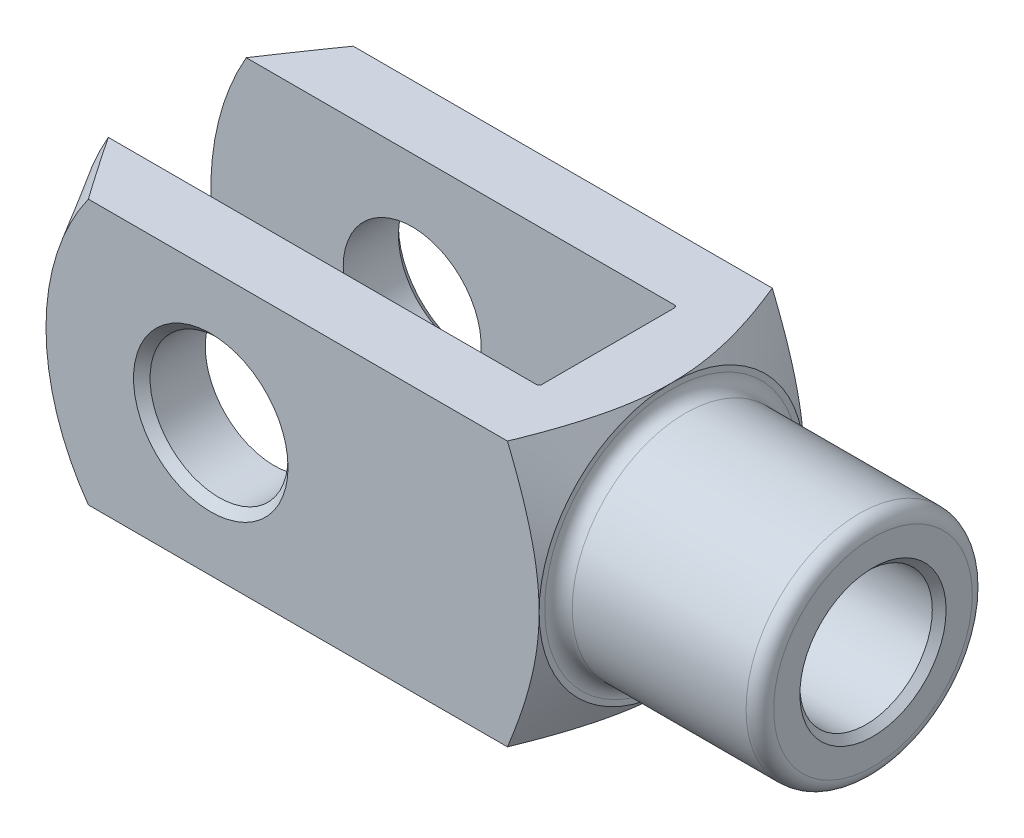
ISO-10303-21;
HEADER;
FILE_DESCRIPTION(('STEP AP214'),'2;1');
FILE_NAME('part.step','',(''),(''),'','','');
FILE_SCHEMA(('AUTOMOTIVE_DESIGN { 1 0 10303 214 1 1 1 1 }'));
ENDSEC;
DATA;
#1=APPLICATION_CONTEXT('core data for automotive mechanical design processes');
#2=APPLICATION_PROTOCOL_DEFINITION('international standard','automotive_design',2000,#1);
#3=PRODUCT_CONTEXT('',#1,'mechanical');
#4=PRODUCT('Part','Part','',(#3));
#5=PRODUCT_RELATED_PRODUCT_CATEGORY('part','',(#4));
#6=PRODUCT_DEFINITION_FORMATION('','',#4);
#7=PRODUCT_DEFINITION_CONTEXT('part definition',#1,'design');
#8=PRODUCT_DEFINITION('design','',#6,#7);
#9=PRODUCT_DEFINITION_SHAPE('','',#8);
#10=(LENGTH_UNIT() NAMED_UNIT(*) SI_UNIT(.MILLI.,.METRE.));
#11=(NAMED_UNIT(*) PLANE_ANGLE_UNIT() SI_UNIT($,.RADIAN.));
#12=(NAMED_UNIT(*) SI_UNIT($,.STERADIAN.) SOLID_ANGLE_UNIT());
#13=UNCERTAINTY_MEASURE_WITH_UNIT(LENGTH_MEASURE(1.E-05),#10,'distance_accuracy_value','');
#14=(GEOMETRIC_REPRESENTATION_CONTEXT(3) GLOBAL_UNCERTAINTY_ASSIGNED_CONTEXT((#13)) GLOBAL_UNIT_ASSIGNED_CONTEXT((#10,
#11,#12)) REPRESENTATION_CONTEXT('',''));
#15=CARTESIAN_POINT('',(0.,0.,0.));
#16=DIRECTION('',(0.,0.,1.));
#17=DIRECTION('',(1.,0.,0.));
#18=AXIS2_PLACEMENT_3D('',#15,#16,#17);
#19=CARTESIAN_POINT('',(-96.,-48.,-25.));
#20=DIRECTION('',(1.,0.,0.));
#21=DIRECTION('',(0.,0.,-1.));
#22=AXIS2_PLACEMENT_3D('',#19,#20,#21);
#23=PLANE('',#22);
#24=DIRECTION('',(0.,1.,0.));
#25=VECTOR('',#24,1.);
#26=CARTESIAN_POINT('',(-96.,-48.,-24.));
#27=LINE('',#26,#25);
#28=CARTESIAN_POINT('',(-96.,48.,-24.));
#29=VERTEX_POINT('',#28);
#30=CARTESIAN_POINT('',(-96.,0.,-24.));
#31=VERTEX_POINT('',#30);
#32=EDGE_CURVE('E144',#29,#31,#27,.F.);
#33=ORIENTED_EDGE('',*,*,#32,.T.);
#34=CARTESIAN_POINT('',(-96.,0.,0.));
#35=DIRECTION('',(1.,0.,0.));
#36=DIRECTION('',(0.,0.,-1.));
#37=AXIS2_PLACEMENT_3D('',#34,#35,#36);
#38=CIRCLE('',#37,24.);
#39=CARTESIAN_POINT('',(-96.,0.,24.));
#40=VERTEX_POINT('',#39);
#41=EDGE_CURVE('E52',#31,#40,#38,.T.);
#42=ORIENTED_EDGE('',*,*,#41,.T.);
#43=DIRECTION('',(0.,1.,0.));
#44=VECTOR('',#43,1.);
#45=CARTESIAN_POINT('',(-96.,48.,24.));
#46=LINE('',#45,#44);
#47=CARTESIAN_POINT('',(-96.,48.,24.));
#48=VERTEX_POINT('',#47);
#49=EDGE_CURVE('E141',#40,#48,#46,.T.);
#50=ORIENTED_EDGE('',*,*,#49,.T.);
#51=DIRECTION('',(0.,0.,-1.));
#52=VECTOR('',#51,1.);
#53=CARTESIAN_POINT('',(-96.,48.,-25.));
#54=LINE('',#53,#52);
#55=EDGE_CURVE('E323',#48,#29,#54,.T.);
#56=ORIENTED_EDGE('',*,*,#55,.T.);
#57=EDGE_LOOP('',(#33,#42,#50,#56));
#58=FACE_BOUND('',#57,.T.);
#59=ADVANCED_FACE('F37',(#58),#23,.F.);
#60=CARTESIAN_POINT('',(-265.,-48.,-25.));
#61=DIRECTION('',(0.,0.,-1.));
#62=DIRECTION('',(-1.,0.,0.));
#63=AXIS2_PLACEMENT_3D('',#60,#61,#62);
#64=PLANE('',#63);
#65=CARTESIAN_POINT('',(-192.,0.,-25.));
#66=DIRECTION('',(0.,0.,-1.));
#67=DIRECTION('',(-1.,0.,0.));
#68=AXIS2_PLACEMENT_3D('',#65,#66,#67);
#69=CIRCLE('',#68,25.);
#70=CARTESIAN_POINT('',(-217.,0.,-25.));
#71=VERTEX_POINT('',#70);
#72=EDGE_CURVE('E351',#71,#71,#69,.F.);
#73=ORIENTED_EDGE('',*,*,#72,.F.);
#74=EDGE_LOOP('',(#73));
#75=FACE_BOUND('',#74,.T.);
#76=DIRECTION('',(-1.,0.,0.));
#77=VECTOR('',#76,1.);
#78=CARTESIAN_POINT('',(-265.,48.,-25.));
#79=LINE('',#78,#77);
#80=CARTESIAN_POINT('',(-97.,48.,-25.));
#81=VERTEX_POINT('',#80);
#82=CARTESIAN_POINT('',(-252.138438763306,48.,-25.));
#83=VERTEX_POINT('',#82);
#84=EDGE_CURVE('E329',#81,#83,#79,.T.);
#85=ORIENTED_EDGE('',*,*,#84,.T.);
#86=CARTESIAN_POINT('',(-169.,0.,-25.));
#87=DIRECTION('',(0.,0.,1.));
#88=DIRECTION('',(1.,0.,0.));
#89=AXIS2_PLACEMENT_3D('',#86,#87,#88);
#90=CIRCLE('',#89,96.);
#91=CARTESIAN_POINT('',(-252.138438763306,-48.,-25.));
#92=VERTEX_POINT('',#91);
#93=EDGE_CURVE('E262',#83,#92,#90,.T.);
#94=ORIENTED_EDGE('',*,*,#93,.T.);
#95=DIRECTION('',(-1.,0.,0.));
#96=VECTOR('',#95,1.);
#97=CARTESIAN_POINT('',(-265.,-48.,-25.));
#98=LINE('',#97,#96);
#99=CARTESIAN_POINT('',(-97.,-48.,-25.));
#100=VERTEX_POINT('',#99);
#101=EDGE_CURVE('E318',#100,#92,#98,.T.);
#102=ORIENTED_EDGE('',*,*,#101,.F.);
#103=DIRECTION('',(0.,1.,0.));
#104=VECTOR('',#103,1.);
#105=CARTESIAN_POINT('',(-97.,48.,-25.));
#106=LINE('',#105,#104);
#107=EDGE_CURVE('E168',#100,#81,#106,.T.);
#108=ORIENTED_EDGE('',*,*,#107,.T.);
#109=EDGE_LOOP('',(#85,#94,#102,#108));
#110=FACE_BOUND('',#109,.T.);
#111=ADVANCED_FACE('F361',(#75,#110),#64,.F.);
#112=CARTESIAN_POINT('',(-265.,-48.,25.));
#113=DIRECTION('',(0.,0.,1.));
#114=DIRECTION('',(1.,0.,0.));
#115=AXIS2_PLACEMENT_3D('',#112,#113,#114);
#116=PLANE('',#115);
#117=CARTESIAN_POINT('',(-192.,0.,25.));
#118=DIRECTION('',(0.,0.,1.));
#119=DIRECTION('',(1.,0.,0.));
#120=AXIS2_PLACEMENT_3D('',#117,#118,#119);
#121=CIRCLE('',#120,25.);
#122=CARTESIAN_POINT('',(-167.,0.,25.));
#123=VERTEX_POINT('',#122);
#124=EDGE_CURVE('E328',#123,#123,#121,.F.);
#125=ORIENTED_EDGE('',*,*,#124,.F.);
#126=EDGE_LOOP('',(#125));
#127=FACE_BOUND('',#126,.T.);
#128=CARTESIAN_POINT('',(-169.,0.,25.));
#129=DIRECTION('',(0.,0.,1.));
#130=DIRECTION('',(1.,0.,0.));
#131=AXIS2_PLACEMENT_3D('',#128,#129,#130);
#132=CIRCLE('',#131,96.);
#133=CARTESIAN_POINT('',(-252.138438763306,48.,25.));
#134=VERTEX_POINT('',#133);
#135=CARTESIAN_POINT('',(-252.138438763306,-48.,25.));
#136=VERTEX_POINT('',#135);
#137=EDGE_CURVE('E146',#134,#136,#132,.T.);
#138=ORIENTED_EDGE('',*,*,#137,.F.);
#139=DIRECTION('',(1.,0.,0.));
#140=VECTOR('',#139,1.);
#141=CARTESIAN_POINT('',(-265.,48.,25.));
#142=LINE('',#141,#140);
#143=CARTESIAN_POINT('',(-97.,48.,25.));
#144=VERTEX_POINT('',#143);
#145=EDGE_CURVE('E333',#134,#144,#142,.T.);
#146=ORIENTED_EDGE('',*,*,#145,.T.);
#147=DIRECTION('',(0.,1.,0.));
#148=VECTOR('',#147,1.);
#149=CARTESIAN_POINT('',(-97.,-48.,25.));
#150=LINE('',#149,#148);
#151=CARTESIAN_POINT('',(-97.,-48.,25.));
#152=VERTEX_POINT('',#151);
#153=EDGE_CURVE('E163',#144,#152,#150,.F.);
#154=ORIENTED_EDGE('',*,*,#153,.T.);
#155=DIRECTION('',(1.,0.,0.));
#156=VECTOR('',#155,1.);
#157=CARTESIAN_POINT('',(-265.,-48.,25.));
#158=LINE('',#157,#156);
#159=EDGE_CURVE('E322',#136,#152,#158,.T.);
#160=ORIENTED_EDGE('',*,*,#159,.F.);
#161=EDGE_LOOP('',(#138,#146,#154,#160));
#162=FACE_BOUND('',#161,.T.);
#163=ADVANCED_FACE('F364',(#127,#162),#116,.F.);
#164=CARTESIAN_POINT('',(-265.,-48.,48.));
#165=DIRECTION('',(0.,0.,1.));
#166=DIRECTION('',(1.,0.,0.));
#167=AXIS2_PLACEMENT_3D('',#164,#165,#166);
#168=PLANE('',#167);
#169=CARTESIAN_POINT('',(-192.,0.,48.));
#170=DIRECTION('',(0.,0.,1.));
#171=DIRECTION('',(1.,0.,0.));
#172=AXIS2_PLACEMENT_3D('',#169,#170,#171);
#173=CIRCLE('',#172,28.);
#174=CARTESIAN_POINT('',(-164.,0.,48.));
#175=VERTEX_POINT('',#174);
#176=EDGE_CURVE('E215',#175,#175,#173,.F.);
#177=ORIENTED_EDGE('',*,*,#176,.T.);
#178=EDGE_LOOP('',(#177));
#179=FACE_BOUND('',#178,.T.);
#180=DIRECTION('',(1.,0.,0.));
#181=VECTOR('',#180,1.);
#182=CARTESIAN_POINT('',(-265.,48.,48.));
#183=LINE('',#182,#181);
#184=CARTESIAN_POINT('',(-236.370279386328,48.,48.));
#185=VERTEX_POINT('',#184);
#186=CARTESIAN_POINT('',(-84.4790229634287,48.,48.));
#187=VERTEX_POINT('',#186);
#188=EDGE_CURVE('E348',#185,#187,#183,.T.);
#189=ORIENTED_EDGE('',*,*,#188,.F.);
#190=CARTESIAN_POINT('',(-169.,0.,48.));
#191=DIRECTION('',(0.,0.,1.));
#192=DIRECTION('',(1.,0.,0.));
#193=AXIS2_PLACEMENT_3D('',#190,#191,#192);
#194=CIRCLE('',#193,82.7209438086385);
#195=CARTESIAN_POINT('',(-236.370279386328,-48.,48.));
#196=VERTEX_POINT('',#195);
#197=EDGE_CURVE('E60',#185,#196,#194,.T.);
#198=ORIENTED_EDGE('',*,*,#197,.T.);
#199=DIRECTION('',(1.,0.,0.));
#200=VECTOR('',#199,1.);
#201=CARTESIAN_POINT('',(-265.,-48.,48.));
#202=LINE('',#201,#200);
#203=CARTESIAN_POINT('',(-84.4790229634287,-48.,48.));
#204=VERTEX_POINT('',#203);
#205=EDGE_CURVE('E345',#196,#204,#202,.T.);
#206=ORIENTED_EDGE('',*,*,#205,.T.);
#207=CARTESIAN_POINT('',(-108.308192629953,-98.0354090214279,48.));
#208=CARTESIAN_POINT('',(-107.694862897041,-96.8525739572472,48.));
#209=CARTESIAN_POINT('',(-107.083209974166,-95.6688681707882,48.));
#210=CARTESIAN_POINT('',(-105.863625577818,-93.2995363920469,48.));
#211=CARTESIAN_POINT('',(-105.255694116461,-92.1139103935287,48.));
#212=CARTESIAN_POINT('',(-104.043892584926,-89.740504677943,48.));
#213=CARTESIAN_POINT('',(-103.440022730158,-88.5527248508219,48.));
#214=CARTESIAN_POINT('',(-102.236818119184,-86.1748731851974,48.));
#215=CARTESIAN_POINT('',(-101.637483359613,-84.9848013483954,48.));
#216=CARTESIAN_POINT('',(-99.8449063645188,-81.4066664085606,48.));
#217=CARTESIAN_POINT('',(-98.6592031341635,-79.0148119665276,48.));
#218=CARTESIAN_POINT('',(-96.8993793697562,-75.4178937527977,48.));
#219=CARTESIAN_POINT('',(-96.3158968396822,-74.2174056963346,48.));
#220=CARTESIAN_POINT('',(-95.1559400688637,-71.813049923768,48.));
#221=CARTESIAN_POINT('',(-94.579465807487,-70.609182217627,48.));
#222=CARTESIAN_POINT('',(-93.3991550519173,-68.1235233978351,48.));
#223=CARTESIAN_POINT('',(-92.7958173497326,-66.8414952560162,48.));
#224=CARTESIAN_POINT('',(-91.5992081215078,-64.2727443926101,48.));
#225=CARTESIAN_POINT('',(-91.0059366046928,-62.9860216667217,48.));
#226=CARTESIAN_POINT('',(-89.8308392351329,-60.4072661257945,48.));
#227=CARTESIAN_POINT('',(-89.2490140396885,-59.1152330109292,48.));
#228=CARTESIAN_POINT('',(-88.0985090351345,-56.5253226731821,48.));
#229=CARTESIAN_POINT('',(-87.5298292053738,-55.2274454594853,48.));
#230=CARTESIAN_POINT('',(-86.4078262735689,-52.6257418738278,48.));
#231=CARTESIAN_POINT('',(-85.8544964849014,-51.3219183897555,48.));
#232=CARTESIAN_POINT('',(-84.7652471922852,-48.7069951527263,48.));
#233=CARTESIAN_POINT('',(-84.2293278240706,-47.3958953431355,48.));
#234=CARTESIAN_POINT('',(-83.1776937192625,-44.7657404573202,48.));
#235=CARTESIAN_POINT('',(-82.6619771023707,-43.4466861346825,48.));
#236=CARTESIAN_POINT('',(-81.6539528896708,-40.7996857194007,48.));
#237=CARTESIAN_POINT('',(-81.1616447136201,-39.4717398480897,48.));
#238=CARTESIAN_POINT('',(-80.1004124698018,-36.5170564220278,48.));
#239=CARTESIAN_POINT('',(-79.5380186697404,-34.8879592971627,48.));
#240=CARTESIAN_POINT('',(-78.461578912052,-31.6137870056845,48.));
#241=CARTESIAN_POINT('',(-77.9475329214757,-29.9687118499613,48.));
#242=CARTESIAN_POINT('',(-76.9774060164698,-26.6615412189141,48.));
#243=CARTESIAN_POINT('',(-76.5213214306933,-24.9994468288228,48.));
#244=CARTESIAN_POINT('',(-75.677983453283,-21.6577740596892,48.));
#245=CARTESIAN_POINT('',(-75.2907292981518,-19.9781958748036,48.));
#246=CARTESIAN_POINT('',(-74.6048773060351,-16.6418443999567,48.));
#247=CARTESIAN_POINT('',(-74.3044117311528,-14.9854612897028,48.));
#248=CARTESIAN_POINT('',(-73.919211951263,-12.4908559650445,48.));
#249=CARTESIAN_POINT('',(-73.8017248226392,-11.657613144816,48.));
#250=CARTESIAN_POINT('',(-73.5897307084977,-9.98822265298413,48.));
#251=CARTESIAN_POINT('',(-73.4952226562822,-9.15207511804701,48.));
#252=CARTESIAN_POINT('',(-73.3302464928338,-7.47792979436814,48.));
#253=CARTESIAN_POINT('',(-73.2597635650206,-6.6399334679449,48.));
#254=CARTESIAN_POINT('',(-73.1435455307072,-4.96221844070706,48.));
#255=CARTESIAN_POINT('',(-73.0978104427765,-4.12249973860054,48.));
#256=CARTESIAN_POINT('',(-73.031622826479,-2.44208544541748,48.));
#257=CARTESIAN_POINT('',(-73.0111696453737,-1.60138988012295,48.));
#258=CARTESIAN_POINT('',(-72.9957879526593,0.0802322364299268,48.));
#259=CARTESIAN_POINT('',(-73.0008592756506,0.921158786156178,48.));
#260=CARTESIAN_POINT('',(-73.0351658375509,2.54119808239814,48.));
#261=CARTESIAN_POINT('',(-73.0626131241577,3.32034936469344,48.));
#262=CARTESIAN_POINT('',(-73.1391107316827,4.87758350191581,48.));
#263=CARTESIAN_POINT('',(-73.1881609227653,5.65566636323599,48.));
#264=CARTESIAN_POINT('',(-73.3073786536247,7.21018865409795,48.));
#265=CARTESIAN_POINT('',(-73.3775455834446,7.98662813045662,48.));
#266=CARTESIAN_POINT('',(-73.5383215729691,9.53739823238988,48.));
#267=CARTESIAN_POINT('',(-73.6289314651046,10.3117287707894,48.));
#268=CARTESIAN_POINT('',(-73.9303235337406,12.6316009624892,48.));
#269=CARTESIAN_POINT('',(-74.1706179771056,14.1733850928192,48.));
#270=CARTESIAN_POINT('',(-74.7220114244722,17.2440731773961,48.));
#271=CARTESIAN_POINT('',(-75.0331124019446,18.7729767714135,48.));
#272=CARTESIAN_POINT('',(-75.7273608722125,21.8607684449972,48.));
#273=CARTESIAN_POINT('',(-76.112333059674,23.4192435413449,48.));
#274=CARTESIAN_POINT('',(-76.938793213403,26.5210574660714,48.));
#275=CARTESIAN_POINT('',(-77.3802817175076,28.0643961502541,48.));
#276=CARTESIAN_POINT('',(-78.0784956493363,30.3683481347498,48.));
#277=CARTESIAN_POINT('',(-78.3172280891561,31.1344823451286,48.));
#278=CARTESIAN_POINT('',(-78.8057436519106,32.6632254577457,48.));
#279=CARTESIAN_POINT('',(-79.0555267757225,33.4258343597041,48.));
#280=CARTESIAN_POINT('',(-79.5652216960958,34.9476047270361,48.));
#281=CARTESIAN_POINT('',(-79.8251329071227,35.7067663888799,48.));
#282=CARTESIAN_POINT('',(-80.3542695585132,37.2218281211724,48.));
#283=CARTESIAN_POINT('',(-80.6234949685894,37.9777282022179,48.));
#284=CARTESIAN_POINT('',(-81.4885501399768,40.3637234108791,48.));
#285=CARTESIAN_POINT('',(-82.1000879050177,41.9881389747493,48.));
#286=CARTESIAN_POINT('',(-83.3563664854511,45.2241183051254,48.));
#287=CARTESIAN_POINT('',(-84.0011093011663,46.8356812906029,48.));
#288=CARTESIAN_POINT('',(-85.318437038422,50.0477869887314,48.));
#289=CARTESIAN_POINT('',(-85.9910281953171,51.6483271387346,48.));
#290=CARTESIAN_POINT('',(-87.359419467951,54.8393953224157,48.));
#291=CARTESIAN_POINT('',(-88.055219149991,56.4299235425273,48.));
#292=CARTESIAN_POINT('',(-89.4670028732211,59.6036265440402,48.));
#293=CARTESIAN_POINT('',(-90.1830038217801,61.1867937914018,48.));
#294=CARTESIAN_POINT('',(-91.6316329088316,64.3454990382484,48.));
#295=CARTESIAN_POINT('',(-92.3642611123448,65.9210370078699,48.));
#296=CARTESIAN_POINT('',(-93.8436136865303,69.0652561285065,48.));
#297=CARTESIAN_POINT('',(-94.5903364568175,70.6339380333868,48.));
#298=CARTESIAN_POINT('',(-96.0959449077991,73.7654452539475,48.));
#299=CARTESIAN_POINT('',(-96.8548305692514,75.3282705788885,48.));
#300=CARTESIAN_POINT('',(-98.3854277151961,78.4535290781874,48.));
#301=CARTESIAN_POINT('',(-99.1571712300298,80.01594655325,48.));
#302=CARTESIAN_POINT('',(-100.709821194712,83.1362193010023,48.));
#303=CARTESIAN_POINT('',(-101.490727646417,84.6940745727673,48.));
#304=CARTESIAN_POINT('',(-103.060545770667,87.8057825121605,48.));
#305=CARTESIAN_POINT('',(-103.849457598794,89.3596351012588,48.));
#306=CARTESIAN_POINT('',(-105.434292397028,92.4637620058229,48.));
#307=CARTESIAN_POINT('',(-106.230215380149,94.0140363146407,48.));
#308=CARTESIAN_POINT('',(-108.626421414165,98.6585597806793,48.));
#309=CARTESIAN_POINT('',(-110.23592310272,101.748054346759,48.));
#310=CARTESIAN_POINT('',(-113.474200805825,107.916877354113,48.));
#311=CARTESIAN_POINT('',(-115.102976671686,110.996205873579,48.));
#312=CARTESIAN_POINT('',(-118.13294338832,116.689941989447,48.));
#313=CARTESIAN_POINT('',(-119.532010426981,119.305480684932,48.));
#314=CARTESIAN_POINT('',(-122.339516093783,124.531524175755,48.));
#315=CARTESIAN_POINT('',(-123.747954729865,127.142028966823,48.));
#316=CARTESIAN_POINT('',(-126.572935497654,132.359123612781,48.));
#317=CARTESIAN_POINT('',(-127.989478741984,134.965712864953,48.));
#318=CARTESIAN_POINT('',(-130.829294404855,140.175220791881,48.));
#319=CARTESIAN_POINT('',(-132.252566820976,142.778139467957,48.));
#320=CARTESIAN_POINT('',(-135.096714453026,147.965911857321,48.));
#321=CARTESIAN_POINT('',(-136.517556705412,150.550783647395,48.));
#322=CARTESIAN_POINT('',(-139.364175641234,155.717809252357,48.));
#323=CARTESIAN_POINT('',(-140.789952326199,158.299963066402,48.));
#324=CARTESIAN_POINT('',(-143.645568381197,163.461489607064,48.));
#325=CARTESIAN_POINT('',(-145.075407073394,166.04086270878,48.));
#326=CARTESIAN_POINT('',(-147.938852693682,171.197512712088,48.));
#327=CARTESIAN_POINT('',(-149.372459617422,173.774789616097,48.));
#328=CARTESIAN_POINT('',(-150.80769290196,176.351159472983,48.));
#329=B_SPLINE_CURVE_WITH_KNOTS('',3,(#207,#208,#209,#210,#211,#212,#213,#214,#215,#216,#217,
#218,#219,#220,#221,#222,#223,#224,#225,#226,#227,#228,#229,#230,#231,#232,#233,#234,#235,#236,
#237,#238,#239,#240,#241,#242,#243,#244,#245,#246,#247,#248,#249,#250,#251,#252,#253,#254,#255,
#256,#257,#258,#259,#260,#261,#262,#263,#264,#265,#266,#267,#268,#269,#270,#271,#272,#273,#274,
#275,#276,#277,#278,#279,#280,#281,#282,#283,#284,#285,#286,#287,#288,#289,#290,#291,#292,#293,
#294,#295,#296,#297,#298,#299,#300,#301,#302,#303,#304,#305,#306,#307,#308,#309,#310,#311,#312,
#313,#314,#315,#316,#317,#318,#319,#320,#321,#322,#323,#324,#325,#326,#327,#328),.UNSPECIFIED.,
.F.,.F.,(4,2,2,2,2,2,2,2,2,2,2,2,2,2,2,2,2,2,2,2,2,2,2,2,2,2,2,2,2,2,2,2,2,2,2,2,2,2,2,2,2,2,2,
2,2,2,2,2,2,2,2,2,2,2,2,2,2,2,2,2,4),(0.,3.99718034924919,7.99437370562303,11.9917774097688,
15.9891781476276,23.9978898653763,28.0021962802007,32.0064909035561,36.2571599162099,
40.5078328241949,44.7587491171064,49.0096587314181,53.2586865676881,57.5077475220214,
61.7564120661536,66.0049712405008,71.1746492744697,76.3443237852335,81.5136706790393,
86.6829602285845,91.7309053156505,94.2550942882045,96.7791660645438,99.3016783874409,
101.824192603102,104.346641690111,106.869074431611,109.207677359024,111.546266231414,
113.884787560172,116.223404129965,120.902555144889,125.581836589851,130.396555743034,
135.211320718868,137.618658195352,140.025995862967,142.433194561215,144.840385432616,
150.047034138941,155.253996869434,160.46213183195,165.670169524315,170.882703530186,
176.095257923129,181.307223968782,186.519181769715,191.747017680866,196.974854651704,
202.202793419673,207.430741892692,217.881445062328,228.332067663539,237.230690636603,
246.129321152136,255.02920410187,263.92908385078,272.777986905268,281.626892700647,
290.474399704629,299.321896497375),.UNSPECIFIED.);
#330=CARTESIAN_POINT('',(-73.,0.,48.));
#331=VERTEX_POINT('',#330);
#332=EDGE_CURVE('E291',#331,#204,#329,.F.);
#333=ORIENTED_EDGE('',*,*,#332,.F.);
#334=EDGE_CURVE('E289',#187,#331,#329,.F.);
#335=ORIENTED_EDGE('',*,*,#334,.F.);
#336=EDGE_LOOP('',(#189,#198,#206,#333,#335));
#337=FACE_BOUND('',#336,.T.);
#338=ADVANCED_FACE('F273',(#179,#337),#168,.T.);
#339=CARTESIAN_POINT('',(-265.,-48.,48.));
#340=DIRECTION('',(0.,-1.,0.));
#341=DIRECTION('',(0.,0.,-1.));
#342=AXIS2_PLACEMENT_3D('',#339,#340,#341);
#343=PLANE('',#342);
#344=ORIENTED_EDGE('',*,*,#101,.T.);
#345=CARTESIAN_POINT('',(-312.454037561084,-48.,70.7330128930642));
#346=CARTESIAN_POINT('',(-311.128214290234,-48.,68.5553003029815));
#347=CARTESIAN_POINT('',(-309.801047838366,-48.,66.3784056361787));
#348=CARTESIAN_POINT('',(-307.143782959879,-48.,62.0264050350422));
#349=CARTESIAN_POINT('',(-305.813684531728,-48.,59.8512991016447));
#350=CARTESIAN_POINT('',(-301.818604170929,-48.,53.3288632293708));
#351=CARTESIAN_POINT('',(-299.14885783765,-48.,48.9844491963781));
#352=CARTESIAN_POINT('',(-293.793929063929,-48.,40.3044324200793));
#353=CARTESIAN_POINT('',(-291.108744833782,-48.,35.9688307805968));
#354=CARTESIAN_POINT('',(-285.720179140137,-48.,27.3089572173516));
#355=CARTESIAN_POINT('',(-283.016797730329,-48.,22.9846852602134));
#356=CARTESIAN_POINT('',(-278.948035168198,-48.,16.5135257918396));
#357=CARTESIAN_POINT('',(-277.591006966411,-48.,14.3613848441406));
#358=CARTESIAN_POINT('',(-274.870785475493,-48.,10.0610034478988));
#359=CARTESIAN_POINT('',(-273.507592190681,-48.,7.91276299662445));
#360=CARTESIAN_POINT('',(-270.774325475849,-48.,3.62064067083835));
#361=CARTESIAN_POINT('',(-269.404251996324,-48.,1.47675882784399));
#362=CARTESIAN_POINT('',(-266.65641010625,-48.,-2.80606868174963));
#363=CARTESIAN_POINT('',(-265.27864169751,-48.,-4.94501434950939));
#364=CARTESIAN_POINT('',(-262.51439761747,-48.,-9.21738179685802));
#365=CARTESIAN_POINT('',(-261.127921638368,-48.,-11.3508033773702));
#366=CARTESIAN_POINT('',(-258.34517510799,-48.,-15.6112553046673));
#367=CARTESIAN_POINT('',(-256.948904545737,-48.,-17.7382856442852));
#368=CARTESIAN_POINT('',(-254.145239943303,-48.,-21.9849740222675));
#369=CARTESIAN_POINT('',(-252.737846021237,-48.,-24.1046321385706));
#370=CARTESIAN_POINT('',(-249.910316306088,-48.,-28.3354272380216));
#371=CARTESIAN_POINT('',(-248.490180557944,-48.,-30.446564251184));
#372=CARTESIAN_POINT('',(-245.63293449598,-48.,-34.6622646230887));
#373=CARTESIAN_POINT('',(-244.195800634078,-48.,-36.7668120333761));
#374=CARTESIAN_POINT('',(-241.304432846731,-48.,-40.9641147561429));
#375=CARTESIAN_POINT('',(-239.850199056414,-48.,-43.0568701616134));
#376=CARTESIAN_POINT('',(-236.922043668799,-48.,-47.2278204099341));
#377=CARTESIAN_POINT('',(-235.448126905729,-48.,-49.3060186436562));
#378=CARTESIAN_POINT('',(-232.476576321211,-48.,-53.4455106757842));
#379=CARTESIAN_POINT('',(-230.978941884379,-48.,-55.5068040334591));
#380=CARTESIAN_POINT('',(-228.710342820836,-48.,-58.5843266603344));
#381=CARTESIAN_POINT('',(-227.949984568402,-48.,-59.6083806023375));
#382=CARTESIAN_POINT('',(-226.421455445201,-48.,-61.6506440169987));
#383=CARTESIAN_POINT('',(-225.653284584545,-48.,-62.6688534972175));
#384=CARTESIAN_POINT('',(-224.108392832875,-48.,-64.6986605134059));
#385=CARTESIAN_POINT('',(-223.331672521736,-48.,-65.7102584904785));
#386=CARTESIAN_POINT('',(-221.768725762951,-48.,-67.7260826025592));
#387=CARTESIAN_POINT('',(-220.982499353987,-48.,-68.730308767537));
#388=CARTESIAN_POINT('',(-219.39888927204,-48.,-70.7311876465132));
#389=CARTESIAN_POINT('',(-218.601497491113,-48.,-71.7278339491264));
#390=CARTESIAN_POINT('',(-216.994961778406,-48.,-73.711588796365));
#391=CARTESIAN_POINT('',(-216.185818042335,-48.,-74.6986974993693));
#392=CARTESIAN_POINT('',(-214.554172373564,-48.,-76.6622430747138));
#393=CARTESIAN_POINT('',(-213.731667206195,-48.,-77.6386772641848));
#394=CARTESIAN_POINT('',(-212.486808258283,-48.,-79.0938731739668));
#395=CARTESIAN_POINT('',(-212.069992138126,-48.,-79.5773772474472));
#396=CARTESIAN_POINT('',(-211.232427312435,-48.,-80.5409752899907));
#397=CARTESIAN_POINT('',(-210.811678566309,-48.,-81.0210692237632));
#398=CARTESIAN_POINT('',(-210.388847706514,-48.,-81.4993290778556));
#399=B_SPLINE_CURVE_WITH_KNOTS('',3,(#345,#346,#347,#348,#349,#350,#351,#352,#353,#354,#355,
#356,#357,#358,#359,#360,#361,#362,#363,#364,#365,#366,#367,#368,#369,#370,#371,#372,#373,#374,
#375,#376,#377,#378,#379,#380,#381,#382,#383,#384,#385,#386,#387,#388,#389,#390,#391,#392,#393,
#394,#395,#396,#397,#398),.UNSPECIFIED.,.F.,.F.,(4,2,2,2,2,2,2,2,2,2,2,2,2,2,2,2,2,2,2,2,2,2,2,
2,2,2,4),(0.,7.64866915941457,15.2973423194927,30.5948079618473,45.8940843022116,
61.1933155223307,68.8260736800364,76.4588264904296,84.0916342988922,91.7244403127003,
99.3575176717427,106.990603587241,114.623608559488,122.256586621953,129.90179238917,
137.54693778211,145.190238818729,152.833738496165,156.660127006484,160.486510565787,
164.312636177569,168.138746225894,171.967795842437,175.796781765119,179.62670888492,
181.541789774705,183.456890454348),.UNSPECIFIED.);
#400=CARTESIAN_POINT('',(-236.370279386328,-48.,-48.));
#401=VERTEX_POINT('',#400);
#402=EDGE_CURVE('E261',#92,#401,#399,.T.);
#403=ORIENTED_EDGE('',*,*,#402,.T.);
#404=DIRECTION('',(1.,0.,0.));
#405=VECTOR('',#404,1.);
#406=CARTESIAN_POINT('',(-265.,-48.,-48.));
#407=LINE('',#406,#405);
#408=CARTESIAN_POINT('',(-84.4790229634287,-48.,-48.));
#409=VERTEX_POINT('',#408);
#410=EDGE_CURVE('E342',#401,#409,#407,.T.);
#411=ORIENTED_EDGE('',*,*,#410,.T.);
#412=CARTESIAN_POINT('',(-108.308192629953,-48.,-98.0354090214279));
#413=CARTESIAN_POINT('',(-107.694862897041,-48.,-96.8525739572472));
#414=CARTESIAN_POINT('',(-107.083209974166,-48.,-95.6688681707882));
#415=CARTESIAN_POINT('',(-105.863625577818,-48.,-93.2995363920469));
#416=CARTESIAN_POINT('',(-105.255694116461,-48.,-92.1139103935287));
#417=CARTESIAN_POINT('',(-104.043892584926,-48.,-89.740504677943));
#418=CARTESIAN_POINT('',(-103.440022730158,-48.,-88.5527248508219));
#419=CARTESIAN_POINT('',(-102.236818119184,-48.,-86.1748731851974));
#420=CARTESIAN_POINT('',(-101.637483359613,-48.,-84.9848013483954));
#421=CARTESIAN_POINT('',(-99.8449063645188,-48.,-81.4066664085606));
#422=CARTESIAN_POINT('',(-98.6592031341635,-48.,-79.0148119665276));
#423=CARTESIAN_POINT('',(-96.8993793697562,-48.,-75.4178937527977));
#424=CARTESIAN_POINT('',(-96.3158968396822,-48.,-74.2174056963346));
#425=CARTESIAN_POINT('',(-95.1559400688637,-48.,-71.813049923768));
#426=CARTESIAN_POINT('',(-94.579465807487,-48.,-70.609182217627));
#427=CARTESIAN_POINT('',(-93.3991550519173,-48.,-68.1235233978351));
#428=CARTESIAN_POINT('',(-92.7958173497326,-48.,-66.8414952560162));
#429=CARTESIAN_POINT('',(-91.5992081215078,-48.,-64.2727443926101));
#430=CARTESIAN_POINT('',(-91.0059366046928,-48.,-62.9860216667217));
#431=CARTESIAN_POINT('',(-89.8308392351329,-48.,-60.4072661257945));
#432=CARTESIAN_POINT('',(-89.2490140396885,-48.,-59.1152330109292));
#433=CARTESIAN_POINT('',(-88.0985090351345,-48.,-56.5253226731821));
#434=CARTESIAN_POINT('',(-87.5298292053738,-48.,-55.2274454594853));
#435=CARTESIAN_POINT('',(-86.4078262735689,-48.,-52.6257418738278));
#436=CARTESIAN_POINT('',(-85.8544964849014,-48.,-51.3219183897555));
#437=CARTESIAN_POINT('',(-84.7652471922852,-48.,-48.7069951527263));
#438=CARTESIAN_POINT('',(-84.2293278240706,-48.,-47.3958953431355));
#439=CARTESIAN_POINT('',(-83.1776937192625,-48.,-44.7657404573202));
#440=CARTESIAN_POINT('',(-82.6619771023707,-48.,-43.4466861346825));
#441=CARTESIAN_POINT('',(-81.6539528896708,-48.,-40.7996857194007));
#442=CARTESIAN_POINT('',(-81.1616447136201,-48.,-39.4717398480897));
#443=CARTESIAN_POINT('',(-80.1004124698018,-48.,-36.5170564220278));
#444=CARTESIAN_POINT('',(-79.5380186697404,-48.,-34.8879592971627));
#445=CARTESIAN_POINT('',(-78.461578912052,-48.,-31.6137870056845));
#446=CARTESIAN_POINT('',(-77.9475329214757,-48.,-29.9687118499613));
#447=CARTESIAN_POINT('',(-76.9774060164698,-48.,-26.6615412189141));
#448=CARTESIAN_POINT('',(-76.5213214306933,-48.,-24.9994468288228));
#449=CARTESIAN_POINT('',(-75.677983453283,-48.,-21.6577740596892));
#450=CARTESIAN_POINT('',(-75.2907292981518,-48.,-19.9781958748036));
#451=CARTESIAN_POINT('',(-74.6048773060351,-48.,-16.6418443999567));
#452=CARTESIAN_POINT('',(-74.3044117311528,-48.,-14.9854612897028));
#453=CARTESIAN_POINT('',(-73.919211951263,-48.,-12.4908559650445));
#454=CARTESIAN_POINT('',(-73.8017248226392,-48.,-11.657613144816));
#455=CARTESIAN_POINT('',(-73.5897307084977,-48.,-9.98822265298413));
#456=CARTESIAN_POINT('',(-73.4952226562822,-48.,-9.15207511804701));
#457=CARTESIAN_POINT('',(-73.3302464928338,-48.,-7.47792979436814));
#458=CARTESIAN_POINT('',(-73.2597635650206,-48.,-6.6399334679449));
#459=CARTESIAN_POINT('',(-73.1435455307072,-48.,-4.96221844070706));
#460=CARTESIAN_POINT('',(-73.0978104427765,-48.,-4.12249973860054));
#461=CARTESIAN_POINT('',(-73.031622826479,-48.,-2.44208544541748));
#462=CARTESIAN_POINT('',(-73.0111696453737,-48.,-1.60138988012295));
#463=CARTESIAN_POINT('',(-72.9957879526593,-48.,0.0802322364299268));
#464=CARTESIAN_POINT('',(-73.0008592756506,-48.,0.921158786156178));
#465=CARTESIAN_POINT('',(-73.0351658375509,-48.,2.54119808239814));
#466=CARTESIAN_POINT('',(-73.0626131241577,-48.,3.32034936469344));
#467=CARTESIAN_POINT('',(-73.1391107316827,-48.,4.87758350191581));
#468=CARTESIAN_POINT('',(-73.1881609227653,-48.,5.65566636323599));
#469=CARTESIAN_POINT('',(-73.3073786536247,-48.,7.21018865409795));
#470=CARTESIAN_POINT('',(-73.3775455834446,-48.,7.98662813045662));
#471=CARTESIAN_POINT('',(-73.5383215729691,-48.,9.53739823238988));
#472=CARTESIAN_POINT('',(-73.6289314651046,-48.,10.3117287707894));
#473=CARTESIAN_POINT('',(-73.9303235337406,-48.,12.6316009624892));
#474=CARTESIAN_POINT('',(-74.1706179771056,-48.,14.1733850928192));
#475=CARTESIAN_POINT('',(-74.7220114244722,-48.,17.2440731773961));
#476=CARTESIAN_POINT('',(-75.0331124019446,-48.,18.7729767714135));
#477=CARTESIAN_POINT('',(-75.7273608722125,-48.,21.8607684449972));
#478=CARTESIAN_POINT('',(-76.112333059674,-48.,23.4192435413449));
#479=CARTESIAN_POINT('',(-76.938793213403,-48.,26.5210574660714));
#480=CARTESIAN_POINT('',(-77.3802817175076,-48.,28.0643961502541));
#481=CARTESIAN_POINT('',(-78.0784956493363,-48.,30.3683481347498));
#482=CARTESIAN_POINT('',(-78.3172280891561,-48.,31.1344823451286));
#483=CARTESIAN_POINT('',(-78.8057436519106,-48.,32.6632254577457));
#484=CARTESIAN_POINT('',(-79.0555267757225,-48.,33.4258343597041));
#485=CARTESIAN_POINT('',(-79.5652216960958,-48.,34.9476047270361));
#486=CARTESIAN_POINT('',(-79.8251329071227,-48.,35.7067663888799));
#487=CARTESIAN_POINT('',(-80.3542695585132,-48.,37.2218281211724));
#488=CARTESIAN_POINT('',(-80.6234949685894,-48.,37.9777282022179));
#489=CARTESIAN_POINT('',(-81.4885501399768,-48.,40.3637234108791));
#490=CARTESIAN_POINT('',(-82.1000879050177,-48.,41.9881389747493));
#491=CARTESIAN_POINT('',(-83.3563664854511,-48.,45.2241183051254));
#492=CARTESIAN_POINT('',(-84.0011093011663,-48.,46.8356812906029));
#493=CARTESIAN_POINT('',(-85.318437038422,-48.,50.0477869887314));
#494=CARTESIAN_POINT('',(-85.9910281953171,-48.,51.6483271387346));
#495=CARTESIAN_POINT('',(-87.359419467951,-48.,54.8393953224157));
#496=CARTESIAN_POINT('',(-88.055219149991,-48.,56.4299235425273));
#497=CARTESIAN_POINT('',(-89.4670028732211,-48.,59.6036265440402));
#498=CARTESIAN_POINT('',(-90.1830038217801,-48.,61.1867937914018));
#499=CARTESIAN_POINT('',(-91.6316329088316,-48.,64.3454990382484));
#500=CARTESIAN_POINT('',(-92.3642611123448,-48.,65.9210370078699));
#501=CARTESIAN_POINT('',(-93.8436136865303,-48.,69.0652561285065));
#502=CARTESIAN_POINT('',(-94.5903364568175,-48.,70.6339380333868));
#503=CARTESIAN_POINT('',(-96.0959449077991,-48.,73.7654452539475));
#504=CARTESIAN_POINT('',(-96.8548305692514,-48.,75.3282705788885));
#505=CARTESIAN_POINT('',(-98.3854277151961,-48.,78.4535290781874));
#506=CARTESIAN_POINT('',(-99.1571712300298,-48.,80.01594655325));
#507=CARTESIAN_POINT('',(-100.709821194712,-48.,83.1362193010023));
#508=CARTESIAN_POINT('',(-101.490727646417,-48.,84.6940745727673));
#509=CARTESIAN_POINT('',(-103.060545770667,-48.,87.8057825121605));
#510=CARTESIAN_POINT('',(-103.849457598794,-48.,89.3596351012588));
#511=CARTESIAN_POINT('',(-105.434292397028,-48.,92.4637620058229));
#512=CARTESIAN_POINT('',(-106.230215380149,-48.,94.0140363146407));
#513=CARTESIAN_POINT('',(-108.626421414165,-48.,98.6585597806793));
#514=CARTESIAN_POINT('',(-110.23592310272,-48.,101.748054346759));
#515=CARTESIAN_POINT('',(-113.474200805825,-48.,107.916877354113));
#516=CARTESIAN_POINT('',(-115.102976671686,-48.,110.996205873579));
#517=CARTESIAN_POINT('',(-118.13294338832,-48.,116.689941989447));
#518=CARTESIAN_POINT('',(-119.532010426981,-48.,119.305480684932));
#519=CARTESIAN_POINT('',(-122.339516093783,-48.,124.531524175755));
#520=CARTESIAN_POINT('',(-123.747954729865,-48.,127.142028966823));
#521=CARTESIAN_POINT('',(-126.572935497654,-48.,132.359123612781));
#522=CARTESIAN_POINT('',(-127.989478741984,-48.,134.965712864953));
#523=CARTESIAN_POINT('',(-130.829294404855,-48.,140.175220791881));
#524=CARTESIAN_POINT('',(-132.252566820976,-48.,142.778139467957));
#525=CARTESIAN_POINT('',(-135.096714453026,-48.,147.965911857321));
#526=CARTESIAN_POINT('',(-136.517556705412,-48.,150.550783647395));
#527=CARTESIAN_POINT('',(-139.364175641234,-48.,155.717809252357));
#528=CARTESIAN_POINT('',(-140.789952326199,-48.,158.299963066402));
#529=CARTESIAN_POINT('',(-143.645568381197,-48.,163.461489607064));
#530=CARTESIAN_POINT('',(-145.075407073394,-48.,166.04086270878));
#531=CARTESIAN_POINT('',(-147.938852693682,-48.,171.197512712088));
#532=CARTESIAN_POINT('',(-149.372459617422,-48.,173.774789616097));
#533=CARTESIAN_POINT('',(-150.80769290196,-48.,176.351159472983));
#534=B_SPLINE_CURVE_WITH_KNOTS('',3,(#412,#413,#414,#415,#416,#417,#418,#419,#420,#421,#422,
#423,#424,#425,#426,#427,#428,#429,#430,#431,#432,#433,#434,#435,#436,#437,#438,#439,#440,#441,
#442,#443,#444,#445,#446,#447,#448,#449,#450,#451,#452,#453,#454,#455,#456,#457,#458,#459,#460,
#461,#462,#463,#464,#465,#466,#467,#468,#469,#470,#471,#472,#473,#474,#475,#476,#477,#478,#479,
#480,#481,#482,#483,#484,#485,#486,#487,#488,#489,#490,#491,#492,#493,#494,#495,#496,#497,#498,
#499,#500,#501,#502,#503,#504,#505,#506,#507,#508,#509,#510,#511,#512,#513,#514,#515,#516,#517,
#518,#519,#520,#521,#522,#523,#524,#525,#526,#527,#528,#529,#530,#531,#532,#533),.UNSPECIFIED.,
.F.,.F.,(4,2,2,2,2,2,2,2,2,2,2,2,2,2,2,2,2,2,2,2,2,2,2,2,2,2,2,2,2,2,2,2,2,2,2,2,2,2,2,2,2,2,2,
2,2,2,2,2,2,2,2,2,2,2,2,2,2,2,2,2,4),(0.,3.99718034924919,7.99437370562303,11.9917774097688,
15.9891781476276,23.9978898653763,28.0021962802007,32.0064909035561,36.2571599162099,
40.5078328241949,44.7587491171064,49.0096587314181,53.2586865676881,57.5077475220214,
61.7564120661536,66.0049712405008,71.1746492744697,76.3443237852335,81.5136706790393,
86.6829602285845,91.7309053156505,94.2550942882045,96.7791660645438,99.3016783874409,
101.824192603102,104.346641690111,106.869074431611,109.207677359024,111.546266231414,
113.884787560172,116.223404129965,120.902555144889,125.581836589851,130.396555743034,
135.211320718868,137.618658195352,140.025995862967,142.433194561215,144.840385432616,
150.047034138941,155.253996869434,160.46213183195,165.670169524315,170.882703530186,
176.095257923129,181.307223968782,186.519181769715,191.747017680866,196.974854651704,
202.202793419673,207.430741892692,217.881445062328,228.332067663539,237.230690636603,
246.129321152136,255.02920410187,263.92908385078,272.777986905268,281.626892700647,
290.474399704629,299.321896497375),.UNSPECIFIED.);
#535=CARTESIAN_POINT('',(-73.,-48.,0.));
#536=VERTEX_POINT('',#535);
#537=EDGE_CURVE('E290',#536,#409,#534,.F.);
#538=ORIENTED_EDGE('',*,*,#537,.F.);
#539=EDGE_CURVE('E281',#204,#536,#534,.F.);
#540=ORIENTED_EDGE('',*,*,#539,.F.);
#541=ORIENTED_EDGE('',*,*,#205,.F.);
#542=CARTESIAN_POINT('',(-210.388847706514,-48.,81.4993290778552));
#543=CARTESIAN_POINT('',(-210.811678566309,-48.,81.0210692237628));
#544=CARTESIAN_POINT('',(-211.232427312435,-48.,80.5409752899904));
#545=CARTESIAN_POINT('',(-212.069992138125,-48.,79.5773772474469));
#546=CARTESIAN_POINT('',(-212.486808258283,-48.,79.0938731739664));
#547=CARTESIAN_POINT('',(-213.731667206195,-48.,77.6386772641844));
#548=CARTESIAN_POINT('',(-214.554172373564,-48.,76.6622430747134));
#549=CARTESIAN_POINT('',(-216.185818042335,-48.,74.698697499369));
#550=CARTESIAN_POINT('',(-216.994961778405,-48.,73.7115887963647));
#551=CARTESIAN_POINT('',(-218.601497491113,-48.,71.7278339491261));
#552=CARTESIAN_POINT('',(-219.39888927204,-48.,70.731187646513));
#553=CARTESIAN_POINT('',(-220.982499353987,-48.,68.7303087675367));
#554=CARTESIAN_POINT('',(-221.768725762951,-48.,67.726082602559));
#555=CARTESIAN_POINT('',(-223.331672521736,-48.,65.7102584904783));
#556=CARTESIAN_POINT('',(-224.108392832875,-48.,64.6986605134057));
#557=CARTESIAN_POINT('',(-225.653284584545,-48.,62.6688534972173));
#558=CARTESIAN_POINT('',(-226.421455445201,-48.,61.6506440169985));
#559=CARTESIAN_POINT('',(-227.949984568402,-48.,59.6083806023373));
#560=CARTESIAN_POINT('',(-228.710342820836,-48.,58.5843266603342));
#561=CARTESIAN_POINT('',(-230.978941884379,-48.,55.506804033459));
#562=CARTESIAN_POINT('',(-232.476576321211,-48.,53.4455106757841));
#563=CARTESIAN_POINT('',(-235.448126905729,-48.,49.3060186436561));
#564=CARTESIAN_POINT('',(-236.922043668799,-48.,47.227820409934));
#565=CARTESIAN_POINT('',(-239.850199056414,-48.,43.0568701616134));
#566=CARTESIAN_POINT('',(-241.304432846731,-48.,40.9641147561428));
#567=CARTESIAN_POINT('',(-244.195800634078,-48.,36.766812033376));
#568=CARTESIAN_POINT('',(-245.63293449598,-48.,34.6622646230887));
#569=CARTESIAN_POINT('',(-248.490180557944,-48.,30.446564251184));
#570=CARTESIAN_POINT('',(-249.910316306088,-48.,28.3354272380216));
#571=CARTESIAN_POINT('',(-252.737846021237,-48.,24.1046321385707));
#572=CARTESIAN_POINT('',(-254.145239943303,-48.,21.9849740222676));
#573=CARTESIAN_POINT('',(-256.948904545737,-48.,17.7382856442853));
#574=CARTESIAN_POINT('',(-258.34517510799,-48.,15.6112553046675));
#575=CARTESIAN_POINT('',(-261.127921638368,-48.,11.3508033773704));
#576=CARTESIAN_POINT('',(-262.51439761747,-48.,9.21738179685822));
#577=CARTESIAN_POINT('',(-265.27864169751,-48.,4.94501434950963));
#578=CARTESIAN_POINT('',(-266.65641010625,-48.,2.80606868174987));
#579=CARTESIAN_POINT('',(-269.404251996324,-48.,-1.47675882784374));
#580=CARTESIAN_POINT('',(-270.774325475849,-48.,-3.6206406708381));
#581=CARTESIAN_POINT('',(-273.507592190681,-48.,-7.91276299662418));
#582=CARTESIAN_POINT('',(-274.870785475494,-48.,-10.0610034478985));
#583=CARTESIAN_POINT('',(-277.591006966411,-48.,-14.3613848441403));
#584=CARTESIAN_POINT('',(-278.948035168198,-48.,-16.5135257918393));
#585=CARTESIAN_POINT('',(-283.016797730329,-48.,-22.9846852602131));
#586=CARTESIAN_POINT('',(-285.720179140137,-48.,-27.3089572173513));
#587=CARTESIAN_POINT('',(-291.108744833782,-48.,-35.9688307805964));
#588=CARTESIAN_POINT('',(-293.793929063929,-48.,-40.3044324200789));
#589=CARTESIAN_POINT('',(-299.14885783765,-48.,-48.9844491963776));
#590=CARTESIAN_POINT('',(-301.81860417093,-48.,-53.3288632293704));
#591=CARTESIAN_POINT('',(-305.813684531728,-48.,-59.8512991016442));
#592=CARTESIAN_POINT('',(-307.14378295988,-48.,-62.0264050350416));
#593=CARTESIAN_POINT('',(-309.801047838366,-48.,-66.3784056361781));
#594=CARTESIAN_POINT('',(-311.128214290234,-48.,-68.5553003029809));
#595=CARTESIAN_POINT('',(-312.454037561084,-48.,-70.7330128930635));
#596=B_SPLINE_CURVE_WITH_KNOTS('',3,(#542,#543,#544,#545,#546,#547,#548,#549,#550,#551,#552,
#553,#554,#555,#556,#557,#558,#559,#560,#561,#562,#563,#564,#565,#566,#567,#568,#569,#570,#571,
#572,#573,#574,#575,#576,#577,#578,#579,#580,#581,#582,#583,#584,#585,#586,#587,#588,#589,#590,
#591,#592,#593,#594,#595),.UNSPECIFIED.,.F.,.F.,(4,2,2,2,2,2,2,2,2,2,2,2,2,2,2,2,2,2,2,2,2,2,2,
2,2,2,4),(0.,1.91510067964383,3.83018156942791,7.66010868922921,11.4890946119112,
15.3181442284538,19.1442542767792,22.9703798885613,26.7967634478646,30.6231519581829,
38.2666516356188,45.9099526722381,53.5550980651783,61.200303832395,68.8332818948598,
76.4662868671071,84.0993727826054,91.7324501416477,99.3652561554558,106.998063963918,
114.630816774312,122.263574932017,137.562806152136,152.862082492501,168.159548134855,
175.808221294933,183.456890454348),.UNSPECIFIED.);
#597=EDGE_CURVE('E252',#196,#136,#596,.T.);
#598=ORIENTED_EDGE('',*,*,#597,.T.);
#599=ORIENTED_EDGE('',*,*,#159,.T.);
#600=CARTESIAN_POINT('',(-97.,-48.,24.));
#601=DIRECTION('',(0.,-1.,0.));
#602=DIRECTION('',(0.,0.,-1.));
#603=AXIS2_PLACEMENT_3D('',#600,#601,#602);
#604=CIRCLE('',#603,1.);
#605=CARTESIAN_POINT('',(-96.,-48.,24.));
#606=VERTEX_POINT('',#605);
#607=EDGE_CURVE('E178',#152,#606,#604,.F.);
#608=ORIENTED_EDGE('',*,*,#607,.T.);
#609=DIRECTION('',(0.,0.,-1.));
#610=VECTOR('',#609,1.);
#611=CARTESIAN_POINT('',(-96.,-48.,-25.));
#612=LINE('',#611,#610);
#613=CARTESIAN_POINT('',(-96.,-48.,-24.));
#614=VERTEX_POINT('',#613);
#615=EDGE_CURVE('E161',#606,#614,#612,.T.);
#616=ORIENTED_EDGE('',*,*,#615,.T.);
#617=CARTESIAN_POINT('',(-97.,-48.,-24.));
#618=DIRECTION('',(0.,-1.,0.));
#619=DIRECTION('',(0.,0.,-1.));
#620=AXIS2_PLACEMENT_3D('',#617,#618,#619);
#621=CIRCLE('',#620,1.);
#622=EDGE_CURVE('E184',#614,#100,#621,.F.);
#623=ORIENTED_EDGE('',*,*,#622,.T.);
#624=EDGE_LOOP('',(#344,#403,#411,#538,#540,#541,#598,#599,#608,#616,#623));
#625=FACE_BOUND('',#624,.T.);
#626=ADVANCED_FACE('F268',(#625),#343,.T.);
#627=CARTESIAN_POINT('',(-265.,-48.,-48.));
#628=DIRECTION('',(0.,0.,-1.));
#629=DIRECTION('',(-1.,0.,0.));
#630=AXIS2_PLACEMENT_3D('',#627,#628,#629);
#631=PLANE('',#630);
#632=CARTESIAN_POINT('',(-192.,0.,-48.));
#633=DIRECTION('',(0.,0.,-1.));
#634=DIRECTION('',(-1.,0.,0.));
#635=AXIS2_PLACEMENT_3D('',#632,#633,#634);
#636=CIRCLE('',#635,28.);
#637=CARTESIAN_POINT('',(-220.,0.,-48.));
#638=VERTEX_POINT('',#637);
#639=EDGE_CURVE('E203',#638,#638,#636,.F.);
#640=ORIENTED_EDGE('',*,*,#639,.T.);
#641=EDGE_LOOP('',(#640));
#642=FACE_BOUND('',#641,.T.);
#643=ORIENTED_EDGE('',*,*,#410,.F.);
#644=CARTESIAN_POINT('',(-169.,0.,-48.));
#645=DIRECTION('',(0.,0.,1.));
#646=DIRECTION('',(1.,0.,0.));
#647=AXIS2_PLACEMENT_3D('',#644,#645,#646);
#648=CIRCLE('',#647,82.7209438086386);
#649=CARTESIAN_POINT('',(-236.370279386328,48.,-48.));
#650=VERTEX_POINT('',#649);
#651=EDGE_CURVE('E444',#650,#401,#648,.T.);
#652=ORIENTED_EDGE('',*,*,#651,.F.);
#653=DIRECTION('',(1.,0.,0.));
#654=VECTOR('',#653,1.);
#655=CARTESIAN_POINT('',(-265.,48.,-48.));
#656=LINE('',#655,#654);
#657=CARTESIAN_POINT('',(-84.4790229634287,48.,-48.));
#658=VERTEX_POINT('',#657);
#659=EDGE_CURVE('E338',#650,#658,#656,.T.);
#660=ORIENTED_EDGE('',*,*,#659,.T.);
#661=CARTESIAN_POINT('',(-108.308192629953,-98.0354090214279,-48.));
#662=CARTESIAN_POINT('',(-107.694862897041,-96.8525739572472,-48.));
#663=CARTESIAN_POINT('',(-107.083209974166,-95.6688681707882,-48.));
#664=CARTESIAN_POINT('',(-105.863625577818,-93.2995363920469,-48.));
#665=CARTESIAN_POINT('',(-105.255694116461,-92.1139103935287,-48.));
#666=CARTESIAN_POINT('',(-104.043892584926,-89.740504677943,-48.));
#667=CARTESIAN_POINT('',(-103.440022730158,-88.5527248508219,-48.));
#668=CARTESIAN_POINT('',(-102.236818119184,-86.1748731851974,-48.));
#669=CARTESIAN_POINT('',(-101.637483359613,-84.9848013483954,-48.));
#670=CARTESIAN_POINT('',(-99.8449063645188,-81.4066664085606,-48.));
#671=CARTESIAN_POINT('',(-98.6592031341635,-79.0148119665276,-48.));
#672=CARTESIAN_POINT('',(-96.8993793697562,-75.4178937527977,-48.));
#673=CARTESIAN_POINT('',(-96.3158968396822,-74.2174056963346,-48.));
#674=CARTESIAN_POINT('',(-95.1559400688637,-71.813049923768,-48.));
#675=CARTESIAN_POINT('',(-94.579465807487,-70.609182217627,-48.));
#676=CARTESIAN_POINT('',(-93.3991550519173,-68.1235233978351,-48.));
#677=CARTESIAN_POINT('',(-92.7958173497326,-66.8414952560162,-48.));
#678=CARTESIAN_POINT('',(-91.5992081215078,-64.2727443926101,-48.));
#679=CARTESIAN_POINT('',(-91.0059366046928,-62.9860216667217,-48.));
#680=CARTESIAN_POINT('',(-89.8308392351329,-60.4072661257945,-48.));
#681=CARTESIAN_POINT('',(-89.2490140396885,-59.1152330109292,-48.));
#682=CARTESIAN_POINT('',(-88.0985090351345,-56.5253226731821,-48.));
#683=CARTESIAN_POINT('',(-87.5298292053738,-55.2274454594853,-48.));
#684=CARTESIAN_POINT('',(-86.4078262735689,-52.6257418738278,-48.));
#685=CARTESIAN_POINT('',(-85.8544964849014,-51.3219183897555,-48.));
#686=CARTESIAN_POINT('',(-84.7652471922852,-48.7069951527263,-48.));
#687=CARTESIAN_POINT('',(-84.2293278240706,-47.3958953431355,-48.));
#688=CARTESIAN_POINT('',(-83.1776937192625,-44.7657404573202,-48.));
#689=CARTESIAN_POINT('',(-82.6619771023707,-43.4466861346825,-48.));
#690=CARTESIAN_POINT('',(-81.6539528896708,-40.7996857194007,-48.));
#691=CARTESIAN_POINT('',(-81.1616447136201,-39.4717398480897,-48.));
#692=CARTESIAN_POINT('',(-80.1004124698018,-36.5170564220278,-48.));
#693=CARTESIAN_POINT('',(-79.5380186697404,-34.8879592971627,-48.));
#694=CARTESIAN_POINT('',(-78.461578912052,-31.6137870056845,-48.));
#695=CARTESIAN_POINT('',(-77.9475329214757,-29.9687118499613,-48.));
#696=CARTESIAN_POINT('',(-76.9774060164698,-26.6615412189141,-48.));
#697=CARTESIAN_POINT('',(-76.5213214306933,-24.9994468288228,-48.));
#698=CARTESIAN_POINT('',(-75.677983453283,-21.6577740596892,-48.));
#699=CARTESIAN_POINT('',(-75.2907292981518,-19.9781958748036,-48.));
#700=CARTESIAN_POINT('',(-74.6048773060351,-16.6418443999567,-48.));
#701=CARTESIAN_POINT('',(-74.3044117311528,-14.9854612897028,-48.));
#702=CARTESIAN_POINT('',(-73.919211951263,-12.4908559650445,-48.));
#703=CARTESIAN_POINT('',(-73.8017248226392,-11.657613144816,-48.));
#704=CARTESIAN_POINT('',(-73.5897307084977,-9.98822265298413,-48.));
#705=CARTESIAN_POINT('',(-73.4952226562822,-9.15207511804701,-48.));
#706=CARTESIAN_POINT('',(-73.3302464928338,-7.47792979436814,-48.));
#707=CARTESIAN_POINT('',(-73.2597635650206,-6.6399334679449,-48.));
#708=CARTESIAN_POINT('',(-73.1435455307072,-4.96221844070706,-48.));
#709=CARTESIAN_POINT('',(-73.0978104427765,-4.12249973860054,-48.));
#710=CARTESIAN_POINT('',(-73.031622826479,-2.44208544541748,-48.));
#711=CARTESIAN_POINT('',(-73.0111696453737,-1.60138988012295,-48.));
#712=CARTESIAN_POINT('',(-72.9957879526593,0.0802322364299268,-48.));
#713=CARTESIAN_POINT('',(-73.0008592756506,0.921158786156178,-48.));
#714=CARTESIAN_POINT('',(-73.0351658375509,2.54119808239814,-48.));
#715=CARTESIAN_POINT('',(-73.0626131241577,3.32034936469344,-48.));
#716=CARTESIAN_POINT('',(-73.1391107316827,4.87758350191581,-48.));
#717=CARTESIAN_POINT('',(-73.1881609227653,5.65566636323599,-48.));
#718=CARTESIAN_POINT('',(-73.3073786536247,7.21018865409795,-48.));
#719=CARTESIAN_POINT('',(-73.3775455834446,7.98662813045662,-48.));
#720=CARTESIAN_POINT('',(-73.5383215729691,9.53739823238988,-48.));
#721=CARTESIAN_POINT('',(-73.6289314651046,10.3117287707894,-48.));
#722=CARTESIAN_POINT('',(-73.9303235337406,12.6316009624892,-48.));
#723=CARTESIAN_POINT('',(-74.1706179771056,14.1733850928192,-48.));
#724=CARTESIAN_POINT('',(-74.7220114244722,17.2440731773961,-48.));
#725=CARTESIAN_POINT('',(-75.0331124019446,18.7729767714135,-48.));
#726=CARTESIAN_POINT('',(-75.7273608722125,21.8607684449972,-48.));
#727=CARTESIAN_POINT('',(-76.112333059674,23.4192435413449,-48.));
#728=CARTESIAN_POINT('',(-76.938793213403,26.5210574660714,-48.));
#729=CARTESIAN_POINT('',(-77.3802817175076,28.0643961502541,-48.));
#730=CARTESIAN_POINT('',(-78.0784956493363,30.3683481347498,-48.));
#731=CARTESIAN_POINT('',(-78.3172280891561,31.1344823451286,-48.));
#732=CARTESIAN_POINT('',(-78.8057436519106,32.6632254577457,-48.));
#733=CARTESIAN_POINT('',(-79.0555267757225,33.4258343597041,-48.));
#734=CARTESIAN_POINT('',(-79.5652216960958,34.9476047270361,-48.));
#735=CARTESIAN_POINT('',(-79.8251329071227,35.7067663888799,-48.));
#736=CARTESIAN_POINT('',(-80.3542695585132,37.2218281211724,-48.));
#737=CARTESIAN_POINT('',(-80.6234949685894,37.9777282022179,-48.));
#738=CARTESIAN_POINT('',(-81.4885501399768,40.3637234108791,-48.));
#739=CARTESIAN_POINT('',(-82.1000879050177,41.9881389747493,-48.));
#740=CARTESIAN_POINT('',(-83.3563664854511,45.2241183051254,-48.));
#741=CARTESIAN_POINT('',(-84.0011093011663,46.8356812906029,-48.));
#742=CARTESIAN_POINT('',(-85.318437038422,50.0477869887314,-48.));
#743=CARTESIAN_POINT('',(-85.9910281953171,51.6483271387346,-48.));
#744=CARTESIAN_POINT('',(-87.359419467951,54.8393953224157,-48.));
#745=CARTESIAN_POINT('',(-88.055219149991,56.4299235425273,-48.));
#746=CARTESIAN_POINT('',(-89.4670028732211,59.6036265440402,-48.));
#747=CARTESIAN_POINT('',(-90.1830038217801,61.1867937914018,-48.));
#748=CARTESIAN_POINT('',(-91.6316329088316,64.3454990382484,-48.));
#749=CARTESIAN_POINT('',(-92.3642611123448,65.9210370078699,-48.));
#750=CARTESIAN_POINT('',(-93.8436136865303,69.0652561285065,-48.));
#751=CARTESIAN_POINT('',(-94.5903364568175,70.6339380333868,-48.));
#752=CARTESIAN_POINT('',(-96.0959449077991,73.7654452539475,-48.));
#753=CARTESIAN_POINT('',(-96.8548305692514,75.3282705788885,-48.));
#754=CARTESIAN_POINT('',(-98.3854277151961,78.4535290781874,-48.));
#755=CARTESIAN_POINT('',(-99.1571712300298,80.01594655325,-48.));
#756=CARTESIAN_POINT('',(-100.709821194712,83.1362193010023,-48.));
#757=CARTESIAN_POINT('',(-101.490727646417,84.6940745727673,-48.));
#758=CARTESIAN_POINT('',(-103.060545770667,87.8057825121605,-48.));
#759=CARTESIAN_POINT('',(-103.849457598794,89.3596351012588,-48.));
#760=CARTESIAN_POINT('',(-105.434292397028,92.4637620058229,-48.));
#761=CARTESIAN_POINT('',(-106.230215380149,94.0140363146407,-48.));
#762=CARTESIAN_POINT('',(-108.626421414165,98.6585597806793,-48.));
#763=CARTESIAN_POINT('',(-110.23592310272,101.748054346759,-48.));
#764=CARTESIAN_POINT('',(-113.474200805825,107.916877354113,-48.));
#765=CARTESIAN_POINT('',(-115.102976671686,110.996205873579,-48.));
#766=CARTESIAN_POINT('',(-118.13294338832,116.689941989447,-48.));
#767=CARTESIAN_POINT('',(-119.532010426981,119.305480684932,-48.));
#768=CARTESIAN_POINT('',(-122.339516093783,124.531524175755,-48.));
#769=CARTESIAN_POINT('',(-123.747954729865,127.142028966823,-48.));
#770=CARTESIAN_POINT('',(-126.572935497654,132.359123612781,-48.));
#771=CARTESIAN_POINT('',(-127.989478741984,134.965712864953,-48.));
#772=CARTESIAN_POINT('',(-130.829294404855,140.175220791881,-48.));
#773=CARTESIAN_POINT('',(-132.252566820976,142.778139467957,-48.));
#774=CARTESIAN_POINT('',(-135.096714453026,147.965911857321,-48.));
#775=CARTESIAN_POINT('',(-136.517556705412,150.550783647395,-48.));
#776=CARTESIAN_POINT('',(-139.364175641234,155.717809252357,-48.));
#777=CARTESIAN_POINT('',(-140.789952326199,158.299963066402,-48.));
#778=CARTESIAN_POINT('',(-143.645568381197,163.461489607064,-48.));
#779=CARTESIAN_POINT('',(-145.075407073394,166.04086270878,-48.));
#780=CARTESIAN_POINT('',(-147.938852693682,171.197512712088,-48.));
#781=CARTESIAN_POINT('',(-149.372459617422,173.774789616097,-48.));
#782=CARTESIAN_POINT('',(-150.80769290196,176.351159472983,-48.));
#783=B_SPLINE_CURVE_WITH_KNOTS('',3,(#661,#662,#663,#664,#665,#666,#667,#668,#669,#670,#671,
#672,#673,#674,#675,#676,#677,#678,#679,#680,#681,#682,#683,#684,#685,#686,#687,#688,#689,#690,
#691,#692,#693,#694,#695,#696,#697,#698,#699,#700,#701,#702,#703,#704,#705,#706,#707,#708,#709,
#710,#711,#712,#713,#714,#715,#716,#717,#718,#719,#720,#721,#722,#723,#724,#725,#726,#727,#728,
#729,#730,#731,#732,#733,#734,#735,#736,#737,#738,#739,#740,#741,#742,#743,#744,#745,#746,#747,
#748,#749,#750,#751,#752,#753,#754,#755,#756,#757,#758,#759,#760,#761,#762,#763,#764,#765,#766,
#767,#768,#769,#770,#771,#772,#773,#774,#775,#776,#777,#778,#779,#780,#781,#782),.UNSPECIFIED.,
.F.,.F.,(4,2,2,2,2,2,2,2,2,2,2,2,2,2,2,2,2,2,2,2,2,2,2,2,2,2,2,2,2,2,2,2,2,2,2,2,2,2,2,2,2,2,2,
2,2,2,2,2,2,2,2,2,2,2,2,2,2,2,2,2,4),(0.,3.99718034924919,7.99437370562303,11.9917774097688,
15.9891781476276,23.9978898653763,28.0021962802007,32.0064909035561,36.2571599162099,
40.5078328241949,44.7587491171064,49.0096587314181,53.2586865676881,57.5077475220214,
61.7564120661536,66.0049712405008,71.1746492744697,76.3443237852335,81.5136706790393,
86.6829602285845,91.7309053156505,94.2550942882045,96.7791660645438,99.3016783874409,
101.824192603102,104.346641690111,106.869074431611,109.207677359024,111.546266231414,
113.884787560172,116.223404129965,120.902555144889,125.581836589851,130.396555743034,
135.211320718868,137.618658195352,140.025995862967,142.433194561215,144.840385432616,
150.047034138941,155.253996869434,160.46213183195,165.670169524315,170.882703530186,
176.095257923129,181.307223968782,186.519181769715,191.747017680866,196.974854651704,
202.202793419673,207.430741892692,217.881445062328,228.332067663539,237.230690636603,
246.129321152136,255.02920410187,263.92908385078,272.777986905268,281.626892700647,
290.474399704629,299.321896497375),.UNSPECIFIED.);
#784=CARTESIAN_POINT('',(-73.,0.,-48.));
#785=VERTEX_POINT('',#784);
#786=EDGE_CURVE('E310',#785,#658,#783,.T.);
#787=ORIENTED_EDGE('',*,*,#786,.F.);
#788=EDGE_CURVE('E317',#409,#785,#783,.T.);
#789=ORIENTED_EDGE('',*,*,#788,.F.);
#790=EDGE_LOOP('',(#643,#652,#660,#787,#789));
#791=FACE_BOUND('',#790,.T.);
#792=ADVANCED_FACE('F272',(#642,#791),#631,.T.);
#793=CARTESIAN_POINT('',(-265.,48.,48.));
#794=DIRECTION('',(0.,1.,0.));
#795=DIRECTION('',(0.,0.,1.));
#796=AXIS2_PLACEMENT_3D('',#793,#794,#795);
#797=PLANE('',#796);
#798=ORIENTED_EDGE('',*,*,#659,.F.);
#799=CARTESIAN_POINT('',(-210.388847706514,48.,-81.4993290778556));
#800=CARTESIAN_POINT('',(-210.811678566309,48.,-81.0210692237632));
#801=CARTESIAN_POINT('',(-211.232427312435,48.,-80.5409752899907));
#802=CARTESIAN_POINT('',(-212.069992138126,48.,-79.5773772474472));
#803=CARTESIAN_POINT('',(-212.486808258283,48.,-79.0938731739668));
#804=CARTESIAN_POINT('',(-213.731667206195,48.,-77.6386772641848));
#805=CARTESIAN_POINT('',(-214.554172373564,48.,-76.6622430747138));
#806=CARTESIAN_POINT('',(-216.185818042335,48.,-74.6986974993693));
#807=CARTESIAN_POINT('',(-216.994961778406,48.,-73.711588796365));
#808=CARTESIAN_POINT('',(-218.601497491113,48.,-71.7278339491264));
#809=CARTESIAN_POINT('',(-219.39888927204,48.,-70.7311876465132));
#810=CARTESIAN_POINT('',(-220.982499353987,48.,-68.730308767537));
#811=CARTESIAN_POINT('',(-221.768725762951,48.,-67.7260826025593));
#812=CARTESIAN_POINT('',(-223.331672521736,48.,-65.7102584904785));
#813=CARTESIAN_POINT('',(-224.108392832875,48.,-64.698660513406));
#814=CARTESIAN_POINT('',(-225.653284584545,48.,-62.6688534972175));
#815=CARTESIAN_POINT('',(-226.421455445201,48.,-61.6506440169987));
#816=CARTESIAN_POINT('',(-227.949984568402,48.,-59.6083806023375));
#817=CARTESIAN_POINT('',(-228.710342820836,48.,-58.5843266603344));
#818=CARTESIAN_POINT('',(-230.978941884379,48.,-55.5068040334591));
#819=CARTESIAN_POINT('',(-232.476576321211,48.,-53.4455106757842));
#820=CARTESIAN_POINT('',(-235.448126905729,48.,-49.3060186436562));
#821=CARTESIAN_POINT('',(-236.922043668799,48.,-47.2278204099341));
#822=CARTESIAN_POINT('',(-239.850199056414,48.,-43.0568701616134));
#823=CARTESIAN_POINT('',(-241.304432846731,48.,-40.9641147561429));
#824=CARTESIAN_POINT('',(-244.195800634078,48.,-36.7668120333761));
#825=CARTESIAN_POINT('',(-245.63293449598,48.,-34.6622646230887));
#826=CARTESIAN_POINT('',(-248.490180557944,48.,-30.446564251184));
#827=CARTESIAN_POINT('',(-249.910316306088,48.,-28.3354272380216));
#828=CARTESIAN_POINT('',(-252.737846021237,48.,-24.1046321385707));
#829=CARTESIAN_POINT('',(-254.145239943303,48.,-21.9849740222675));
#830=CARTESIAN_POINT('',(-256.948904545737,48.,-17.7382856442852));
#831=CARTESIAN_POINT('',(-258.34517510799,48.,-15.6112553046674));
#832=CARTESIAN_POINT('',(-261.127921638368,48.,-11.3508033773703));
#833=CARTESIAN_POINT('',(-262.51439761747,48.,-9.21738179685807));
#834=CARTESIAN_POINT('',(-265.27864169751,48.,-4.94501434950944));
#835=CARTESIAN_POINT('',(-266.65641010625,48.,-2.80606868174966));
#836=CARTESIAN_POINT('',(-269.404251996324,48.,1.47675882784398));
#837=CARTESIAN_POINT('',(-270.774325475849,48.,3.62064067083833));
#838=CARTESIAN_POINT('',(-273.507592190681,48.,7.91276299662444));
#839=CARTESIAN_POINT('',(-274.870785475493,48.,10.0610034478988));
#840=CARTESIAN_POINT('',(-277.591006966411,48.,14.3613848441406));
#841=CARTESIAN_POINT('',(-278.948035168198,48.,16.5135257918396));
#842=CARTESIAN_POINT('',(-283.016797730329,48.,22.9846852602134));
#843=CARTESIAN_POINT('',(-285.720179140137,48.,27.3089572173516));
#844=CARTESIAN_POINT('',(-291.108744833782,48.,35.9688307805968));
#845=CARTESIAN_POINT('',(-293.793929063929,48.,40.3044324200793));
#846=CARTESIAN_POINT('',(-299.14885783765,48.,48.9844491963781));
#847=CARTESIAN_POINT('',(-301.818604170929,48.,53.3288632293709));
#848=CARTESIAN_POINT('',(-305.813684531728,48.,59.8512991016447));
#849=CARTESIAN_POINT('',(-307.143782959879,48.,62.0264050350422));
#850=CARTESIAN_POINT('',(-309.801047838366,48.,66.3784056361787));
#851=CARTESIAN_POINT('',(-311.128214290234,48.,68.5553003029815));
#852=CARTESIAN_POINT('',(-312.454037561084,48.,70.7330128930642));
#853=B_SPLINE_CURVE_WITH_KNOTS('',3,(#799,#800,#801,#802,#803,#804,#805,#806,#807,#808,#809,
#810,#811,#812,#813,#814,#815,#816,#817,#818,#819,#820,#821,#822,#823,#824,#825,#826,#827,#828,
#829,#830,#831,#832,#833,#834,#835,#836,#837,#838,#839,#840,#841,#842,#843,#844,#845,#846,#847,
#848,#849,#850,#851,#852),.UNSPECIFIED.,.F.,.F.,(4,2,2,2,2,2,2,2,2,2,2,2,2,2,2,2,2,2,2,2,2,2,2,
2,2,2,4),(0.,1.91510067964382,3.83018156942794,7.66010868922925,11.4890946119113,
15.3181442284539,19.1442542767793,22.9703798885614,26.7967634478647,30.623151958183,
38.2666516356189,45.9099526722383,53.5550980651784,61.2003038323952,68.83328189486,
76.4662868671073,84.0993727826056,91.732450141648,99.3652561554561,106.998063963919,
114.630816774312,122.263574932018,137.562806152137,152.862082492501,168.159548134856,
175.808221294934,183.456890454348),.UNSPECIFIED.);
#854=EDGE_CURVE('E233',#650,#83,#853,.T.);
#855=ORIENTED_EDGE('',*,*,#854,.T.);
#856=ORIENTED_EDGE('',*,*,#84,.F.);
#857=CARTESIAN_POINT('',(-97.,48.,-24.));
#858=DIRECTION('',(0.,1.,0.));
#859=DIRECTION('',(0.,0.,1.));
#860=AXIS2_PLACEMENT_3D('',#857,#858,#859);
#861=CIRCLE('',#860,1.);
#862=EDGE_CURVE('E181',#81,#29,#861,.F.);
#863=ORIENTED_EDGE('',*,*,#862,.T.);
#864=ORIENTED_EDGE('',*,*,#55,.F.);
#865=CARTESIAN_POINT('',(-97.,48.,24.));
#866=DIRECTION('',(0.,1.,0.));
#867=DIRECTION('',(0.,0.,1.));
#868=AXIS2_PLACEMENT_3D('',#865,#866,#867);
#869=CIRCLE('',#868,1.);
#870=EDGE_CURVE('E154',#48,#144,#869,.F.);
#871=ORIENTED_EDGE('',*,*,#870,.T.);
#872=ORIENTED_EDGE('',*,*,#145,.F.);
#873=CARTESIAN_POINT('',(-312.454037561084,48.,-70.7330128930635));
#874=CARTESIAN_POINT('',(-311.128214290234,48.,-68.5553003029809));
#875=CARTESIAN_POINT('',(-309.801047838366,48.,-66.3784056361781));
#876=CARTESIAN_POINT('',(-307.14378295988,48.,-62.0264050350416));
#877=CARTESIAN_POINT('',(-305.813684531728,48.,-59.8512991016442));
#878=CARTESIAN_POINT('',(-301.81860417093,48.,-53.3288632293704));
#879=CARTESIAN_POINT('',(-299.14885783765,48.,-48.9844491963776));
#880=CARTESIAN_POINT('',(-293.793929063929,48.,-40.3044324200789));
#881=CARTESIAN_POINT('',(-291.108744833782,48.,-35.9688307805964));
#882=CARTESIAN_POINT('',(-285.720179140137,48.,-27.3089572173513));
#883=CARTESIAN_POINT('',(-283.016797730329,48.,-22.9846852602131));
#884=CARTESIAN_POINT('',(-278.948035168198,48.,-16.5135257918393));
#885=CARTESIAN_POINT('',(-277.591006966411,48.,-14.3613848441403));
#886=CARTESIAN_POINT('',(-274.870785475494,48.,-10.0610034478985));
#887=CARTESIAN_POINT('',(-273.507592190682,48.,-7.91276299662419));
#888=CARTESIAN_POINT('',(-270.774325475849,48.,-3.6206406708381));
#889=CARTESIAN_POINT('',(-269.404251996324,48.,-1.47675882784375));
#890=CARTESIAN_POINT('',(-266.65641010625,48.,2.80606868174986));
#891=CARTESIAN_POINT('',(-265.27864169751,48.,4.94501434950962));
#892=CARTESIAN_POINT('',(-262.51439761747,48.,9.21738179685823));
#893=CARTESIAN_POINT('',(-261.127921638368,48.,11.3508033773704));
#894=CARTESIAN_POINT('',(-258.34517510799,48.,15.6112553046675));
#895=CARTESIAN_POINT('',(-256.948904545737,48.,17.7382856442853));
#896=CARTESIAN_POINT('',(-254.145239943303,48.,21.9849740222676));
#897=CARTESIAN_POINT('',(-252.737846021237,48.,24.1046321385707));
#898=CARTESIAN_POINT('',(-249.910316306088,48.,28.3354272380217));
#899=CARTESIAN_POINT('',(-248.490180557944,48.,30.446564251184));
#900=CARTESIAN_POINT('',(-245.63293449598,48.,34.6622646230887));
#901=CARTESIAN_POINT('',(-244.195800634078,48.,36.766812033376));
#902=CARTESIAN_POINT('',(-241.304432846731,48.,40.9641147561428));
#903=CARTESIAN_POINT('',(-239.850199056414,48.,43.0568701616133));
#904=CARTESIAN_POINT('',(-236.922043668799,48.,47.227820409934));
#905=CARTESIAN_POINT('',(-235.448126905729,48.,49.3060186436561));
#906=CARTESIAN_POINT('',(-232.476576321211,48.,53.4455106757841));
#907=CARTESIAN_POINT('',(-230.978941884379,48.,55.506804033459));
#908=CARTESIAN_POINT('',(-228.710342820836,48.,58.5843266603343));
#909=CARTESIAN_POINT('',(-227.949984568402,48.,59.6083806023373));
#910=CARTESIAN_POINT('',(-226.421455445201,48.,61.6506440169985));
#911=CARTESIAN_POINT('',(-225.653284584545,48.,62.6688534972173));
#912=CARTESIAN_POINT('',(-224.108392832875,48.,64.6986605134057));
#913=CARTESIAN_POINT('',(-223.331672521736,48.,65.7102584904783));
#914=CARTESIAN_POINT('',(-221.768725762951,48.,67.726082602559));
#915=CARTESIAN_POINT('',(-220.982499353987,48.,68.7303087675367));
#916=CARTESIAN_POINT('',(-219.39888927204,48.,70.731187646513));
#917=CARTESIAN_POINT('',(-218.601497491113,48.,71.7278339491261));
#918=CARTESIAN_POINT('',(-216.994961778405,48.,73.7115887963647));
#919=CARTESIAN_POINT('',(-216.185818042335,48.,74.698697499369));
#920=CARTESIAN_POINT('',(-214.554172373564,48.,76.6622430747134));
#921=CARTESIAN_POINT('',(-213.731667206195,48.,77.6386772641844));
#922=CARTESIAN_POINT('',(-212.486808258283,48.,79.0938731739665));
#923=CARTESIAN_POINT('',(-212.069992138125,48.,79.5773772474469));
#924=CARTESIAN_POINT('',(-211.232427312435,48.,80.5409752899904));
#925=CARTESIAN_POINT('',(-210.811678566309,48.,81.0210692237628));
#926=CARTESIAN_POINT('',(-210.388847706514,48.,81.4993290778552));
#927=B_SPLINE_CURVE_WITH_KNOTS('',3,(#873,#874,#875,#876,#877,#878,#879,#880,#881,#882,#883,
#884,#885,#886,#887,#888,#889,#890,#891,#892,#893,#894,#895,#896,#897,#898,#899,#900,#901,#902,
#903,#904,#905,#906,#907,#908,#909,#910,#911,#912,#913,#914,#915,#916,#917,#918,#919,#920,#921,
#922,#923,#924,#925,#926),.UNSPECIFIED.,.F.,.F.,(4,2,2,2,2,2,2,2,2,2,2,2,2,2,2,2,2,2,2,2,2,2,2,
2,2,2,4),(0.,7.64866915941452,15.2973423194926,30.5948079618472,45.8940843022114,
61.1933155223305,68.8260736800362,76.4588264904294,84.091634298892,91.7244403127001,
99.3575176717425,106.990603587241,114.623608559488,122.256586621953,129.90179238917,
137.54693778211,145.190238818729,152.833738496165,156.660127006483,160.486510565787,
164.312636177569,168.138746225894,171.967795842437,175.796781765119,179.62670888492,
181.541789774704,183.456890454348),.UNSPECIFIED.);
#928=EDGE_CURVE('E225',#134,#185,#927,.T.);
#929=ORIENTED_EDGE('',*,*,#928,.T.);
#930=ORIENTED_EDGE('',*,*,#188,.T.);
#931=CARTESIAN_POINT('',(-108.308192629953,48.,-98.0354090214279));
#932=CARTESIAN_POINT('',(-107.694862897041,48.,-96.8525739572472));
#933=CARTESIAN_POINT('',(-107.083209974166,48.,-95.6688681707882));
#934=CARTESIAN_POINT('',(-105.863625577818,48.,-93.2995363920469));
#935=CARTESIAN_POINT('',(-105.255694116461,48.,-92.1139103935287));
#936=CARTESIAN_POINT('',(-104.043892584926,48.,-89.740504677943));
#937=CARTESIAN_POINT('',(-103.440022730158,48.,-88.5527248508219));
#938=CARTESIAN_POINT('',(-102.236818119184,48.,-86.1748731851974));
#939=CARTESIAN_POINT('',(-101.637483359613,48.,-84.9848013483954));
#940=CARTESIAN_POINT('',(-99.8449063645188,48.,-81.4066664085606));
#941=CARTESIAN_POINT('',(-98.6592031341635,48.,-79.0148119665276));
#942=CARTESIAN_POINT('',(-96.8993793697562,48.,-75.4178937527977));
#943=CARTESIAN_POINT('',(-96.3158968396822,48.,-74.2174056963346));
#944=CARTESIAN_POINT('',(-95.1559400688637,48.,-71.813049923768));
#945=CARTESIAN_POINT('',(-94.579465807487,48.,-70.609182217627));
#946=CARTESIAN_POINT('',(-93.3991550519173,48.,-68.1235233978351));
#947=CARTESIAN_POINT('',(-92.7958173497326,48.,-66.8414952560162));
#948=CARTESIAN_POINT('',(-91.5992081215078,48.,-64.2727443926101));
#949=CARTESIAN_POINT('',(-91.0059366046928,48.,-62.9860216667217));
#950=CARTESIAN_POINT('',(-89.8308392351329,48.,-60.4072661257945));
#951=CARTESIAN_POINT('',(-89.2490140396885,48.,-59.1152330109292));
#952=CARTESIAN_POINT('',(-88.0985090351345,48.,-56.5253226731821));
#953=CARTESIAN_POINT('',(-87.5298292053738,48.,-55.2274454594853));
#954=CARTESIAN_POINT('',(-86.4078262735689,48.,-52.6257418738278));
#955=CARTESIAN_POINT('',(-85.8544964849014,48.,-51.3219183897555));
#956=CARTESIAN_POINT('',(-84.7652471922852,48.,-48.7069951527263));
#957=CARTESIAN_POINT('',(-84.2293278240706,48.,-47.3958953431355));
#958=CARTESIAN_POINT('',(-83.1776937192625,48.,-44.7657404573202));
#959=CARTESIAN_POINT('',(-82.6619771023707,48.,-43.4466861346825));
#960=CARTESIAN_POINT('',(-81.6539528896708,48.,-40.7996857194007));
#961=CARTESIAN_POINT('',(-81.1616447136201,48.,-39.4717398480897));
#962=CARTESIAN_POINT('',(-80.1004124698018,48.,-36.5170564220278));
#963=CARTESIAN_POINT('',(-79.5380186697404,48.,-34.8879592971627));
#964=CARTESIAN_POINT('',(-78.461578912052,48.,-31.6137870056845));
#965=CARTESIAN_POINT('',(-77.9475329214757,48.,-29.9687118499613));
#966=CARTESIAN_POINT('',(-76.9774060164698,48.,-26.6615412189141));
#967=CARTESIAN_POINT('',(-76.5213214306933,48.,-24.9994468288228));
#968=CARTESIAN_POINT('',(-75.677983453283,48.,-21.6577740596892));
#969=CARTESIAN_POINT('',(-75.2907292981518,48.,-19.9781958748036));
#970=CARTESIAN_POINT('',(-74.6048773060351,48.,-16.6418443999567));
#971=CARTESIAN_POINT('',(-74.3044117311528,48.,-14.9854612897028));
#972=CARTESIAN_POINT('',(-73.919211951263,48.,-12.4908559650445));
#973=CARTESIAN_POINT('',(-73.8017248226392,48.,-11.657613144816));
#974=CARTESIAN_POINT('',(-73.5897307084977,48.,-9.98822265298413));
#975=CARTESIAN_POINT('',(-73.4952226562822,48.,-9.15207511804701));
#976=CARTESIAN_POINT('',(-73.3302464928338,48.,-7.47792979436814));
#977=CARTESIAN_POINT('',(-73.2597635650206,48.,-6.6399334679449));
#978=CARTESIAN_POINT('',(-73.1435455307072,48.,-4.96221844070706));
#979=CARTESIAN_POINT('',(-73.0978104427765,48.,-4.12249973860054));
#980=CARTESIAN_POINT('',(-73.031622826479,48.,-2.44208544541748));
#981=CARTESIAN_POINT('',(-73.0111696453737,48.,-1.60138988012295));
#982=CARTESIAN_POINT('',(-72.9957879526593,48.,0.0802322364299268));
#983=CARTESIAN_POINT('',(-73.0008592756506,48.,0.921158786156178));
#984=CARTESIAN_POINT('',(-73.0351658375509,48.,2.54119808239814));
#985=CARTESIAN_POINT('',(-73.0626131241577,48.,3.32034936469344));
#986=CARTESIAN_POINT('',(-73.1391107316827,48.,4.87758350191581));
#987=CARTESIAN_POINT('',(-73.1881609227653,48.,5.65566636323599));
#988=CARTESIAN_POINT('',(-73.3073786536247,48.,7.21018865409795));
#989=CARTESIAN_POINT('',(-73.3775455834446,48.,7.98662813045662));
#990=CARTESIAN_POINT('',(-73.5383215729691,48.,9.53739823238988));
#991=CARTESIAN_POINT('',(-73.6289314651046,48.,10.3117287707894));
#992=CARTESIAN_POINT('',(-73.9303235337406,48.,12.6316009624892));
#993=CARTESIAN_POINT('',(-74.1706179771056,48.,14.1733850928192));
#994=CARTESIAN_POINT('',(-74.7220114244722,48.,17.2440731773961));
#995=CARTESIAN_POINT('',(-75.0331124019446,48.,18.7729767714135));
#996=CARTESIAN_POINT('',(-75.7273608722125,48.,21.8607684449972));
#997=CARTESIAN_POINT('',(-76.112333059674,48.,23.4192435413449));
#998=CARTESIAN_POINT('',(-76.938793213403,48.,26.5210574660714));
#999=CARTESIAN_POINT('',(-77.3802817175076,48.,28.0643961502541));
#1000=CARTESIAN_POINT('',(-78.0784956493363,48.,30.3683481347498));
#1001=CARTESIAN_POINT('',(-78.3172280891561,48.,31.1344823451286));
#1002=CARTESIAN_POINT('',(-78.8057436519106,48.,32.6632254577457));
#1003=CARTESIAN_POINT('',(-79.0555267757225,48.,33.4258343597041));
#1004=CARTESIAN_POINT('',(-79.5652216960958,48.,34.9476047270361));
#1005=CARTESIAN_POINT('',(-79.8251329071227,48.,35.7067663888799));
#1006=CARTESIAN_POINT('',(-80.3542695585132,48.,37.2218281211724));
#1007=CARTESIAN_POINT('',(-80.6234949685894,48.,37.9777282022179));
#1008=CARTESIAN_POINT('',(-81.4885501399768,48.,40.3637234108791));
#1009=CARTESIAN_POINT('',(-82.1000879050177,48.,41.9881389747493));
#1010=CARTESIAN_POINT('',(-83.3563664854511,48.,45.2241183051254));
#1011=CARTESIAN_POINT('',(-84.0011093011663,48.,46.8356812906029));
#1012=CARTESIAN_POINT('',(-85.318437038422,48.,50.0477869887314));
#1013=CARTESIAN_POINT('',(-85.9910281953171,48.,51.6483271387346));
#1014=CARTESIAN_POINT('',(-87.359419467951,48.,54.8393953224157));
#1015=CARTESIAN_POINT('',(-88.055219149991,48.,56.4299235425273));
#1016=CARTESIAN_POINT('',(-89.4670028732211,48.,59.6036265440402));
#1017=CARTESIAN_POINT('',(-90.1830038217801,48.,61.1867937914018));
#1018=CARTESIAN_POINT('',(-91.6316329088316,48.,64.3454990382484));
#1019=CARTESIAN_POINT('',(-92.3642611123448,48.,65.9210370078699));
#1020=CARTESIAN_POINT('',(-93.8436136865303,48.,69.0652561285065));
#1021=CARTESIAN_POINT('',(-94.5903364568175,48.,70.6339380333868));
#1022=CARTESIAN_POINT('',(-96.0959449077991,48.,73.7654452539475));
#1023=CARTESIAN_POINT('',(-96.8548305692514,48.,75.3282705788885));
#1024=CARTESIAN_POINT('',(-98.3854277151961,48.,78.4535290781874));
#1025=CARTESIAN_POINT('',(-99.1571712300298,48.,80.01594655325));
#1026=CARTESIAN_POINT('',(-100.709821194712,48.,83.1362193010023));
#1027=CARTESIAN_POINT('',(-101.490727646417,48.,84.6940745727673));
#1028=CARTESIAN_POINT('',(-103.060545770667,48.,87.8057825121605));
#1029=CARTESIAN_POINT('',(-103.849457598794,48.,89.3596351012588));
#1030=CARTESIAN_POINT('',(-105.434292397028,48.,92.4637620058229));
#1031=CARTESIAN_POINT('',(-106.230215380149,48.,94.0140363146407));
#1032=CARTESIAN_POINT('',(-108.626421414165,48.,98.6585597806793));
#1033=CARTESIAN_POINT('',(-110.23592310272,48.,101.748054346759));
#1034=CARTESIAN_POINT('',(-113.474200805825,48.,107.916877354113));
#1035=CARTESIAN_POINT('',(-115.102976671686,48.,110.996205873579));
#1036=CARTESIAN_POINT('',(-118.13294338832,48.,116.689941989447));
#1037=CARTESIAN_POINT('',(-119.532010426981,48.,119.305480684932));
#1038=CARTESIAN_POINT('',(-122.339516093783,48.,124.531524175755));
#1039=CARTESIAN_POINT('',(-123.747954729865,48.,127.142028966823));
#1040=CARTESIAN_POINT('',(-126.572935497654,48.,132.359123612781));
#1041=CARTESIAN_POINT('',(-127.989478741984,48.,134.965712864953));
#1042=CARTESIAN_POINT('',(-130.829294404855,48.,140.175220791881));
#1043=CARTESIAN_POINT('',(-132.252566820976,48.,142.778139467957));
#1044=CARTESIAN_POINT('',(-135.096714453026,48.,147.965911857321));
#1045=CARTESIAN_POINT('',(-136.517556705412,48.,150.550783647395));
#1046=CARTESIAN_POINT('',(-139.364175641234,48.,155.717809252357));
#1047=CARTESIAN_POINT('',(-140.789952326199,48.,158.299963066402));
#1048=CARTESIAN_POINT('',(-143.645568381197,48.,163.461489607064));
#1049=CARTESIAN_POINT('',(-145.075407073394,48.,166.04086270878));
#1050=CARTESIAN_POINT('',(-147.938852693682,48.,171.197512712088));
#1051=CARTESIAN_POINT('',(-149.372459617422,48.,173.774789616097));
#1052=CARTESIAN_POINT('',(-150.80769290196,48.,176.351159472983));
#1053=B_SPLINE_CURVE_WITH_KNOTS('',3,(#931,#932,#933,#934,#935,#936,#937,#938,#939,#940,#941,
#942,#943,#944,#945,#946,#947,#948,#949,#950,#951,#952,#953,#954,#955,#956,#957,#958,#959,#960,
#961,#962,#963,#964,#965,#966,#967,#968,#969,#970,#971,#972,#973,#974,#975,#976,#977,#978,#979,
#980,#981,#982,#983,#984,#985,#986,#987,#988,#989,#990,#991,#992,#993,#994,#995,#996,#997,#998,
#999,#1000,#1001,#1002,#1003,#1004,#1005,#1006,#1007,#1008,#1009,#1010,#1011,#1012,#1013,#1014,
#1015,#1016,#1017,#1018,#1019,#1020,#1021,#1022,#1023,#1024,#1025,#1026,#1027,#1028,#1029,#1030,
#1031,#1032,#1033,#1034,#1035,#1036,#1037,#1038,#1039,#1040,#1041,#1042,#1043,#1044,#1045,#1046,
#1047,#1048,#1049,#1050,#1051,#1052),.UNSPECIFIED.,.F.,.F.,(4,2,2,2,2,2,2,2,2,2,2,2,2,2,2,2,2,2,
2,2,2,2,2,2,2,2,2,2,2,2,2,2,2,2,2,2,2,2,2,2,2,2,2,2,2,2,2,2,2,2,2,2,2,2,2,2,2,2,2,2,4),(0.,
3.99718034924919,7.99437370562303,11.9917774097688,15.9891781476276,23.9978898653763,
28.0021962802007,32.0064909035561,36.2571599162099,40.5078328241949,44.7587491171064,
49.0096587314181,53.2586865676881,57.5077475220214,61.7564120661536,66.0049712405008,
71.1746492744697,76.3443237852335,81.5136706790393,86.6829602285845,91.7309053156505,
94.2550942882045,96.7791660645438,99.3016783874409,101.824192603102,104.346641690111,
106.869074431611,109.207677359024,111.546266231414,113.884787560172,116.223404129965,
120.902555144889,125.581836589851,130.396555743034,135.211320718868,137.618658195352,
140.025995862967,142.433194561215,144.840385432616,150.047034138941,155.253996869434,
160.46213183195,165.670169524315,170.882703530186,176.095257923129,181.307223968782,
186.519181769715,191.747017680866,196.974854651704,202.202793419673,207.430741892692,
217.881445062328,228.332067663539,237.230690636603,246.129321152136,255.02920410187,
263.92908385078,272.777986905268,281.626892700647,290.474399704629,299.321896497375),.UNSPECIFIED.);
#1054=CARTESIAN_POINT('',(-73.,48.,0.));
#1055=VERTEX_POINT('',#1054);
#1056=EDGE_CURVE('E288',#1055,#187,#1053,.T.);
#1057=ORIENTED_EDGE('',*,*,#1056,.F.);
#1058=EDGE_CURVE('E454',#658,#1055,#1053,.T.);
#1059=ORIENTED_EDGE('',*,*,#1058,.F.);
#1060=EDGE_LOOP('',(#798,#855,#856,#863,#864,#871,#872,#929,#930,#1057,#1059));
#1061=FACE_BOUND('',#1060,.T.);
#1062=ADVANCED_FACE('F238',(#1061),#797,.T.);
#1063=CARTESIAN_POINT('',(-73.,0.,0.));
#1064=DIRECTION('',(1.,0.,0.));
#1065=DIRECTION('',(0.,0.,-1.));
#1066=AXIS2_PLACEMENT_3D('',#1063,#1064,#1065);
#1067=PLANE('',#1066);
#1068=CARTESIAN_POINT('',(-73.,0.,0.));
#1069=DIRECTION('',(1.,0.,0.));
#1070=DIRECTION('',(0.,0.,-1.));
#1071=AXIS2_PLACEMENT_3D('',#1068,#1069,#1070);
#1072=CIRCLE('',#1071,48.);
#1073=EDGE_CURVE('E224',#785,#536,#1072,.F.);
#1074=ORIENTED_EDGE('',*,*,#1073,.F.);
#1075=EDGE_CURVE('E219',#1055,#785,#1072,.F.);
#1076=ORIENTED_EDGE('',*,*,#1075,.F.);
#1077=CARTESIAN_POINT('',(-73.,0.,0.));
#1078=DIRECTION('',(-1.,0.,0.));
#1079=DIRECTION('',(0.,0.,1.));
#1080=AXIS2_PLACEMENT_3D('',#1077,#1078,#1079);
#1081=CIRCLE('',#1080,48.);
#1082=EDGE_CURVE('E467',#331,#1055,#1081,.T.);
#1083=ORIENTED_EDGE('',*,*,#1082,.F.);
#1084=EDGE_CURVE('E223',#536,#331,#1072,.F.);
#1085=ORIENTED_EDGE('',*,*,#1084,.F.);
#1086=EDGE_LOOP('',(#1074,#1076,#1083,#1085));
#1087=FACE_BOUND('',#1086,.T.);
#1088=CARTESIAN_POINT('',(-73.,0.,0.));
#1089=DIRECTION('',(1.,0.,0.));
#1090=DIRECTION('',(0.,0.,-1.));
#1091=AXIS2_PLACEMENT_3D('',#1088,#1089,#1090);
#1092=CIRCLE('',#1091,46.);
#1093=CARTESIAN_POINT('',(-73.,0.,-46.));
#1094=VERTEX_POINT('',#1093);
#1095=EDGE_CURVE('E199',#1094,#1094,#1092,.F.);
#1096=ORIENTED_EDGE('',*,*,#1095,.T.);
#1097=EDGE_LOOP('',(#1096));
#1098=FACE_BOUND('',#1097,.T.);
#1099=ADVANCED_FACE('F479',(#1087,#1098),#1067,.T.);
#1100=CARTESIAN_POINT('',(-73.,0.,0.));
#1101=DIRECTION('',(1.,0.,0.));
#1102=DIRECTION('',(0.,0.,-1.));
#1103=AXIS2_PLACEMENT_3D('',#1100,#1101,#1102);
#1104=CYLINDRICAL_SURFACE('',#1103,41.);
#1105=CARTESIAN_POINT('',(-5.,0.,0.));
#1106=DIRECTION('',(1.,0.,0.));
#1107=DIRECTION('',(0.,0.,-1.));
#1108=AXIS2_PLACEMENT_3D('',#1105,#1106,#1107);
#1109=CIRCLE('',#1108,41.);
#1110=CARTESIAN_POINT('',(-5.,0.,-41.));
#1111=VERTEX_POINT('',#1110);
#1112=EDGE_CURVE('E195',#1111,#1111,#1109,.F.);
#1113=ORIENTED_EDGE('',*,*,#1112,.T.);
#1114=EDGE_LOOP('',(#1113));
#1115=FACE_BOUND('',#1114,.T.);
#1116=CARTESIAN_POINT('',(-68.,0.,0.));
#1117=DIRECTION('',(1.,0.,0.));
#1118=DIRECTION('',(0.,0.,-1.));
#1119=AXIS2_PLACEMENT_3D('',#1116,#1117,#1118);
#1120=CIRCLE('',#1119,41.);
#1121=CARTESIAN_POINT('',(-68.,0.,-41.));
#1122=VERTEX_POINT('',#1121);
#1123=EDGE_CURVE('E191',#1122,#1122,#1120,.T.);
#1124=ORIENTED_EDGE('',*,*,#1123,.T.);
#1125=EDGE_LOOP('',(#1124));
#1126=FACE_BOUND('',#1125,.T.);
#1127=ADVANCED_FACE('F482',(#1115,#1126),#1104,.T.);
#1128=CARTESIAN_POINT('',(0.,48.,-48.));
#1129=DIRECTION('',(1.,0.,0.));
#1130=DIRECTION('',(0.,0.,-1.));
#1131=AXIS2_PLACEMENT_3D('',#1128,#1129,#1130);
#1132=PLANE('',#1131);
#1133=CARTESIAN_POINT('',(0.,0.,0.));
#1134=DIRECTION('',(1.,0.,0.));
#1135=DIRECTION('',(0.,0.,-1.));
#1136=AXIS2_PLACEMENT_3D('',#1133,#1134,#1135);
#1137=CIRCLE('',#1136,26.4999999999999);
#1138=CARTESIAN_POINT('',(0.,0.,-26.4999999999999));
#1139=VERTEX_POINT('',#1138);
#1140=EDGE_CURVE('E11',#1139,#1139,#1137,.F.);
#1141=ORIENTED_EDGE('',*,*,#1140,.T.);
#1142=EDGE_LOOP('',(#1141));
#1143=FACE_BOUND('',#1142,.T.);
#1144=CARTESIAN_POINT('',(0.,0.,0.));
#1145=DIRECTION('',(1.,0.,0.));
#1146=DIRECTION('',(0.,0.,-1.));
#1147=AXIS2_PLACEMENT_3D('',#1144,#1145,#1146);
#1148=CIRCLE('',#1147,36.);
#1149=CARTESIAN_POINT('',(0.,0.,-36.));
#1150=VERTEX_POINT('',#1149);
#1151=EDGE_CURVE('E187',#1150,#1150,#1148,.T.);
#1152=ORIENTED_EDGE('',*,*,#1151,.T.);
#1153=EDGE_LOOP('',(#1152));
#1154=FACE_BOUND('',#1153,.T.);
#1155=ADVANCED_FACE('F411',(#1143,#1154),#1132,.T.);
#1156=CARTESIAN_POINT('',(-5.,0.,0.));
#1157=DIRECTION('',(1.,0.,0.));
#1158=DIRECTION('',(0.,0.,-1.));
#1159=AXIS2_PLACEMENT_3D('',#1156,#1157,#1158);
#1160=TOROIDAL_SURFACE('',#1159,36.,5.);
#1161=ORIENTED_EDGE('',*,*,#1112,.F.);
#1162=EDGE_LOOP('',(#1161));
#1163=FACE_BOUND('',#1162,.T.);
#1164=ORIENTED_EDGE('',*,*,#1151,.F.);
#1165=EDGE_LOOP('',(#1164));
#1166=FACE_BOUND('',#1165,.T.);
#1167=ADVANCED_FACE('F407',(#1163,#1166),#1160,.T.);
#1168=CARTESIAN_POINT('',(-68.,0.,0.));
#1169=DIRECTION('',(1.,0.,0.));
#1170=DIRECTION('',(0.,0.,-1.));
#1171=AXIS2_PLACEMENT_3D('',#1168,#1169,#1170);
#1172=TOROIDAL_SURFACE('',#1171,46.,5.);
#1173=ORIENTED_EDGE('',*,*,#1095,.F.);
#1174=EDGE_LOOP('',(#1173));
#1175=FACE_BOUND('',#1174,.T.);
#1176=ORIENTED_EDGE('',*,*,#1123,.F.);
#1177=EDGE_LOOP('',(#1176));
#1178=FACE_BOUND('',#1177,.T.);
#1179=ADVANCED_FACE('F410',(#1175,#1178),#1172,.F.);
#1180=CARTESIAN_POINT('',(-73.,0.,0.));
#1181=DIRECTION('',(-1.,0.,0.));
#1182=DIRECTION('',(0.,0.,1.));
#1183=AXIS2_PLACEMENT_3D('',#1180,#1181,#1182);
#1184=CONICAL_SURFACE('',#1183,48.,1.0471975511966);
#1185=ORIENTED_EDGE('',*,*,#786,.T.);
#1186=ORIENTED_EDGE('',*,*,#1058,.T.);
#1187=ORIENTED_EDGE('',*,*,#1075,.T.);
#1188=EDGE_LOOP('',(#1185,#1186,#1187));
#1189=FACE_BOUND('',#1188,.T.);
#1190=ADVANCED_FACE('F414',(#1189),#1184,.T.);
#1191=ORIENTED_EDGE('',*,*,#1056,.T.);
#1192=ORIENTED_EDGE('',*,*,#334,.T.);
#1193=ORIENTED_EDGE('',*,*,#1082,.T.);
#1194=EDGE_LOOP('',(#1191,#1192,#1193));
#1195=FACE_BOUND('',#1194,.T.);
#1196=ADVANCED_FACE('F304',(#1195),#1184,.T.);
#1197=ORIENTED_EDGE('',*,*,#539,.T.);
#1198=ORIENTED_EDGE('',*,*,#1084,.T.);
#1199=ORIENTED_EDGE('',*,*,#332,.T.);
#1200=EDGE_LOOP('',(#1197,#1198,#1199));
#1201=FACE_BOUND('',#1200,.T.);
#1202=ADVANCED_FACE('F299',(#1201),#1184,.T.);
#1203=ORIENTED_EDGE('',*,*,#788,.T.);
#1204=ORIENTED_EDGE('',*,*,#1073,.T.);
#1205=ORIENTED_EDGE('',*,*,#537,.T.);
#1206=EDGE_LOOP('',(#1203,#1204,#1205));
#1207=FACE_BOUND('',#1206,.T.);
#1208=ADVANCED_FACE('F303',(#1207),#1184,.T.);
#1209=CARTESIAN_POINT('',(-192.,0.,-48.));
#1210=DIRECTION('',(0.,0.,1.));
#1211=DIRECTION('',(1.,0.,0.));
#1212=AXIS2_PLACEMENT_3D('',#1209,#1210,#1211);
#1213=CYLINDRICAL_SURFACE('',#1212,25.);
#1214=CARTESIAN_POINT('',(-192.,0.,-45.));
#1215=DIRECTION('',(0.,0.,-1.));
#1216=DIRECTION('',(-1.,0.,0.));
#1217=AXIS2_PLACEMENT_3D('',#1214,#1215,#1216);
#1218=CIRCLE('',#1217,25.);
#1219=CARTESIAN_POINT('',(-217.,0.,-45.));
#1220=VERTEX_POINT('',#1219);
#1221=EDGE_CURVE('E207',#1220,#1220,#1218,.T.);
#1222=ORIENTED_EDGE('',*,*,#1221,.T.);
#1223=EDGE_LOOP('',(#1222));
#1224=FACE_BOUND('',#1223,.T.);
#1225=ORIENTED_EDGE('',*,*,#72,.T.);
#1226=EDGE_LOOP('',(#1225));
#1227=FACE_BOUND('',#1226,.T.);
#1228=ADVANCED_FACE('F359',(#1224,#1227),#1213,.F.);
#1229=CARTESIAN_POINT('',(-192.,0.,45.));
#1230=DIRECTION('',(0.,0.,1.));
#1231=DIRECTION('',(1.,0.,0.));
#1232=AXIS2_PLACEMENT_3D('',#1229,#1230,#1231);
#1233=CIRCLE('',#1232,25.);
#1234=CARTESIAN_POINT('',(-167.,0.,45.));
#1235=VERTEX_POINT('',#1234);
#1236=EDGE_CURVE('E211',#1235,#1235,#1233,.T.);
#1237=ORIENTED_EDGE('',*,*,#1236,.T.);
#1238=EDGE_LOOP('',(#1237));
#1239=FACE_BOUND('',#1238,.T.);
#1240=ORIENTED_EDGE('',*,*,#124,.T.);
#1241=EDGE_LOOP('',(#1240));
#1242=FACE_BOUND('',#1241,.T.);
#1243=ADVANCED_FACE('F402',(#1239,#1242),#1213,.F.);
#1244=CARTESIAN_POINT('',(-192.,0.,-48.));
#1245=DIRECTION('',(0.,0.,-1.));
#1246=DIRECTION('',(-1.,0.,0.));
#1247=AXIS2_PLACEMENT_3D('',#1244,#1245,#1246);
#1248=CONICAL_SURFACE('',#1247,28.,0.785398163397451);
#1249=CARTESIAN_POINT('',(-217.,0.,-45.));
#1250=CARTESIAN_POINT('',(-217.03125,0.,-45.03125));
#1251=CARTESIAN_POINT('',(-217.0625,0.,-45.0625));
#1252=CARTESIAN_POINT('',(-217.125,0.,-45.125));
#1253=CARTESIAN_POINT('',(-217.15625,0.,-45.15625));
#1254=CARTESIAN_POINT('',(-217.21875,0.,-45.21875));
#1255=CARTESIAN_POINT('',(-217.25,0.,-45.25));
#1256=CARTESIAN_POINT('',(-217.3125,0.,-45.3125));
#1257=CARTESIAN_POINT('',(-217.34375,0.,-45.34375));
#1258=CARTESIAN_POINT('',(-217.40625,0.,-45.40625));
#1259=CARTESIAN_POINT('',(-217.4375,0.,-45.4375));
#1260=CARTESIAN_POINT('',(-217.5,0.,-45.5));
#1261=CARTESIAN_POINT('',(-217.53125,0.,-45.53125));
#1262=CARTESIAN_POINT('',(-217.59375,0.,-45.59375));
#1263=CARTESIAN_POINT('',(-217.625,0.,-45.625));
#1264=CARTESIAN_POINT('',(-217.6875,0.,-45.6875));
#1265=CARTESIAN_POINT('',(-217.71875,0.,-45.71875));
#1266=CARTESIAN_POINT('',(-217.78125,0.,-45.78125));
#1267=CARTESIAN_POINT('',(-217.8125,0.,-45.8125));
#1268=CARTESIAN_POINT('',(-217.875,0.,-45.875));
#1269=CARTESIAN_POINT('',(-217.90625,0.,-45.90625));
#1270=CARTESIAN_POINT('',(-217.96875,0.,-45.96875));
#1271=CARTESIAN_POINT('',(-218.,0.,-46.));
#1272=CARTESIAN_POINT('',(-218.0625,0.,-46.0625));
#1273=CARTESIAN_POINT('',(-218.09375,0.,-46.09375));
#1274=CARTESIAN_POINT('',(-218.15625,0.,-46.15625));
#1275=CARTESIAN_POINT('',(-218.1875,0.,-46.1875));
#1276=CARTESIAN_POINT('',(-218.25,0.,-46.25));
#1277=CARTESIAN_POINT('',(-218.28125,0.,-46.28125));
#1278=CARTESIAN_POINT('',(-218.34375,0.,-46.34375));
#1279=CARTESIAN_POINT('',(-218.375,0.,-46.375));
#1280=CARTESIAN_POINT('',(-218.4375,0.,-46.4375));
#1281=CARTESIAN_POINT('',(-218.46875,0.,-46.46875));
#1282=CARTESIAN_POINT('',(-218.53125,0.,-46.53125));
#1283=CARTESIAN_POINT('',(-218.5625,0.,-46.5625));
#1284=CARTESIAN_POINT('',(-218.625,0.,-46.625));
#1285=CARTESIAN_POINT('',(-218.65625,0.,-46.65625));
#1286=CARTESIAN_POINT('',(-218.71875,0.,-46.71875));
#1287=CARTESIAN_POINT('',(-218.75,0.,-46.75));
#1288=CARTESIAN_POINT('',(-218.8125,0.,-46.8125));
#1289=CARTESIAN_POINT('',(-218.84375,0.,-46.84375));
#1290=CARTESIAN_POINT('',(-218.90625,0.,-46.90625));
#1291=CARTESIAN_POINT('',(-218.9375,0.,-46.9375));
#1292=CARTESIAN_POINT('',(-219.,0.,-47.));
#1293=CARTESIAN_POINT('',(-219.03125,0.,-47.03125));
#1294=CARTESIAN_POINT('',(-219.09375,0.,-47.09375));
#1295=CARTESIAN_POINT('',(-219.125,0.,-47.125));
#1296=CARTESIAN_POINT('',(-219.1875,0.,-47.1875));
#1297=CARTESIAN_POINT('',(-219.21875,0.,-47.21875));
#1298=CARTESIAN_POINT('',(-219.28125,0.,-47.28125));
#1299=CARTESIAN_POINT('',(-219.3125,0.,-47.3125));
#1300=CARTESIAN_POINT('',(-219.375,0.,-47.375));
#1301=CARTESIAN_POINT('',(-219.40625,0.,-47.40625));
#1302=CARTESIAN_POINT('',(-219.46875,0.,-47.46875));
#1303=CARTESIAN_POINT('',(-219.5,0.,-47.5));
#1304=CARTESIAN_POINT('',(-219.5625,0.,-47.5625));
#1305=CARTESIAN_POINT('',(-219.59375,0.,-47.59375));
#1306=CARTESIAN_POINT('',(-219.65625,0.,-47.65625));
#1307=CARTESIAN_POINT('',(-219.6875,0.,-47.6875));
#1308=CARTESIAN_POINT('',(-219.75,0.,-47.75));
#1309=CARTESIAN_POINT('',(-219.78125,0.,-47.78125));
#1310=CARTESIAN_POINT('',(-219.84375,0.,-47.84375));
#1311=CARTESIAN_POINT('',(-219.875,0.,-47.875));
#1312=CARTESIAN_POINT('',(-219.9375,0.,-47.9375));
#1313=CARTESIAN_POINT('',(-219.96875,0.,-47.96875));
#1314=CARTESIAN_POINT('',(-220.,0.,-48.));
#1315=B_SPLINE_CURVE_WITH_KNOTS('',3,(#1249,#1250,#1251,#1252,#1253,#1254,#1255,#1256,#1257,
#1258,#1259,#1260,#1261,#1262,#1263,#1264,#1265,#1266,#1267,#1268,#1269,#1270,#1271,#1272,#1273,
#1274,#1275,#1276,#1277,#1278,#1279,#1280,#1281,#1282,#1283,#1284,#1285,#1286,#1287,#1288,#1289,
#1290,#1291,#1292,#1293,#1294,#1295,#1296,#1297,#1298,#1299,#1300,#1301,#1302,#1303,#1304,#1305,
#1306,#1307,#1308,#1309,#1310,#1311,#1312,#1313,#1314),.UNSPECIFIED.,.F.,.F.,(4,2,2,2,2,2,2,2,2,
2,2,2,2,2,2,2,2,2,2,2,2,2,2,2,2,2,2,2,2,2,2,2,4),(0.,0.132582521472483,0.26516504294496,
0.397747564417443,0.530330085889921,0.662912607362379,0.795495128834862,0.928077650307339,
1.06066017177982,1.1932426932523,1.32582521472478,1.45840773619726,1.59099025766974,
1.72357277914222,1.85615530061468,1.98873782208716,2.12132034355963,2.25390286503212,
2.38648538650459,2.51906790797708,2.65165042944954,2.78423295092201,2.9168154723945,
3.04939799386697,3.18198051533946,3.31456303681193,3.44714555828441,3.5797280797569,
3.71231060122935,3.84489312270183,3.97747564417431,4.11005816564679,4.24264068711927),.UNSPECIFIED.);
#1316=EDGE_CURVE('BSEAM396',#1220,#638,#1315,.T.);
#1317=ORIENTED_EDGE('',*,*,#1221,.F.);
#1318=ORIENTED_EDGE('',*,*,#639,.F.);
#1319=ORIENTED_EDGE('',*,*,#1316,.T.);
#1320=ORIENTED_EDGE('',*,*,#1316,.F.);
#1321=EDGE_LOOP('',(#1317,#1319,#1318,#1320));
#1322=FACE_BOUND('',#1321,.T.);
#1323=ADVANCED_FACE('F396',(#1322),#1248,.F.);
#1324=CARTESIAN_POINT('',(-97.,-48.,-24.));
#1325=DIRECTION('',(0.,-1.,0.));
#1326=DIRECTION('',(0.,0.,-1.));
#1327=AXIS2_PLACEMENT_3D('',#1324,#1325,#1326);
#1328=CYLINDRICAL_SURFACE('',#1327,1.);
#1329=ORIENTED_EDGE('',*,*,#622,.F.);
#1330=EDGE_CURVE('E341',#31,#614,#27,.F.);
#1331=ORIENTED_EDGE('',*,*,#1330,.F.);
#1332=ORIENTED_EDGE('',*,*,#32,.F.);
#1333=ORIENTED_EDGE('',*,*,#862,.F.);
#1334=ORIENTED_EDGE('',*,*,#107,.F.);
#1335=EDGE_LOOP('',(#1329,#1331,#1332,#1333,#1334));
#1336=FACE_BOUND('',#1335,.T.);
#1337=ADVANCED_FACE('F391',(#1336),#1328,.F.);
#1338=EDGE_CURVE('E151',#606,#40,#46,.T.);
#1339=ORIENTED_EDGE('',*,*,#1338,.T.);
#1340=EDGE_CURVE('E130',#40,#31,#38,.T.);
#1341=ORIENTED_EDGE('',*,*,#1340,.T.);
#1342=ORIENTED_EDGE('',*,*,#1330,.T.);
#1343=ORIENTED_EDGE('',*,*,#615,.F.);
#1344=EDGE_LOOP('',(#1339,#1341,#1342,#1343));
#1345=FACE_BOUND('',#1344,.T.);
#1346=ADVANCED_FACE('F159',(#1345),#23,.F.);
#1347=CARTESIAN_POINT('',(-97.,-48.,24.));
#1348=DIRECTION('',(0.,-1.,0.));
#1349=DIRECTION('',(0.,0.,-1.));
#1350=AXIS2_PLACEMENT_3D('',#1347,#1348,#1349);
#1351=CYLINDRICAL_SURFACE('',#1350,1.);
#1352=ORIENTED_EDGE('',*,*,#607,.F.);
#1353=ORIENTED_EDGE('',*,*,#153,.F.);
#1354=ORIENTED_EDGE('',*,*,#870,.F.);
#1355=ORIENTED_EDGE('',*,*,#49,.F.);
#1356=ORIENTED_EDGE('',*,*,#1338,.F.);
#1357=EDGE_LOOP('',(#1352,#1353,#1354,#1355,#1356));
#1358=FACE_BOUND('',#1357,.T.);
#1359=ADVANCED_FACE('F150',(#1358),#1351,.F.);
#1360=CARTESIAN_POINT('',(-192.,0.,45.));
#1361=DIRECTION('',(0.,0.,1.));
#1362=DIRECTION('',(1.,0.,0.));
#1363=AXIS2_PLACEMENT_3D('',#1360,#1361,#1362);
#1364=CONICAL_SURFACE('',#1363,25.,0.785398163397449);
#1365=ORIENTED_EDGE('',*,*,#176,.F.);
#1366=EDGE_LOOP('',(#1365));
#1367=FACE_BOUND('',#1366,.T.);
#1368=ORIENTED_EDGE('',*,*,#1236,.F.);
#1369=EDGE_LOOP('',(#1368));
#1370=FACE_BOUND('',#1369,.T.);
#1371=ADVANCED_FACE('F247',(#1367,#1370),#1364,.F.);
#1372=CARTESIAN_POINT('',(-169.,0.,48.));
#1373=DIRECTION('',(0.,0.,-1.));
#1374=DIRECTION('',(-1.,0.,0.));
#1375=AXIS2_PLACEMENT_3D('',#1372,#1373,#1374);
#1376=CONICAL_SURFACE('',#1375,82.7209438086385,0.523598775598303);
#1377=ORIENTED_EDGE('',*,*,#197,.F.);
#1378=ORIENTED_EDGE('',*,*,#928,.F.);
#1379=ORIENTED_EDGE('',*,*,#137,.T.);
#1380=ORIENTED_EDGE('',*,*,#597,.F.);
#1381=EDGE_LOOP('',(#1377,#1378,#1379,#1380));
#1382=FACE_BOUND('',#1381,.T.);
#1383=ADVANCED_FACE('F242',(#1382),#1376,.T.);
#1384=CARTESIAN_POINT('',(-169.,0.,-25.));
#1385=DIRECTION('',(0.,0.,1.));
#1386=DIRECTION('',(1.,0.,0.));
#1387=AXIS2_PLACEMENT_3D('',#1384,#1385,#1386);
#1388=CONICAL_SURFACE('',#1387,96.,0.523598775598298);
#1389=ORIENTED_EDGE('',*,*,#93,.F.);
#1390=ORIENTED_EDGE('',*,*,#854,.F.);
#1391=ORIENTED_EDGE('',*,*,#651,.T.);
#1392=ORIENTED_EDGE('',*,*,#402,.F.);
#1393=EDGE_LOOP('',(#1389,#1390,#1391,#1392));
#1394=FACE_BOUND('',#1393,.T.);
#1395=ADVANCED_FACE('F246',(#1394),#1388,.T.);
#1396=CARTESIAN_POINT('',(-265.,0.,0.));
#1397=DIRECTION('',(1.,0.,0.));
#1398=DIRECTION('',(0.,0.,-1.));
#1399=AXIS2_PLACEMENT_3D('',#1396,#1397,#1398);
#1400=CYLINDRICAL_SURFACE('',#1399,24.);
#1401=CARTESIAN_POINT('',(-2.49999999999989,0.,0.));
#1402=DIRECTION('',(1.,0.,0.));
#1403=DIRECTION('',(0.,0.,-1.));
#1404=AXIS2_PLACEMENT_3D('',#1401,#1402,#1403);
#1405=CIRCLE('',#1404,24.);
#1406=CARTESIAN_POINT('',(-2.49999999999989,0.,-24.));
#1407=VERTEX_POINT('',#1406);
#1408=EDGE_CURVE('E46',#1407,#1407,#1405,.T.);
#1409=ORIENTED_EDGE('',*,*,#1408,.T.);
#1410=EDGE_LOOP('',(#1409));
#1411=FACE_BOUND('',#1410,.T.);
#1412=ORIENTED_EDGE('',*,*,#1340,.F.);
#1413=ORIENTED_EDGE('',*,*,#41,.F.);
#1414=EDGE_LOOP('',(#1412,#1413));
#1415=FACE_BOUND('',#1414,.T.);
#1416=ADVANCED_FACE('F131',(#1411,#1415),#1400,.F.);
#1417=CARTESIAN_POINT('',(-2.49999999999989,0.,0.));
#1418=DIRECTION('',(1.,0.,0.));
#1419=DIRECTION('',(0.,0.,-1.));
#1420=AXIS2_PLACEMENT_3D('',#1417,#1418,#1419);
#1421=CONICAL_SURFACE('',#1420,24.,0.785398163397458);
#1422=ORIENTED_EDGE('',*,*,#1140,.F.);
#1423=EDGE_LOOP('',(#1422));
#1424=FACE_BOUND('',#1423,.T.);
#1425=ORIENTED_EDGE('',*,*,#1408,.F.);
#1426=EDGE_LOOP('',(#1425));
#1427=FACE_BOUND('',#1426,.T.);
#1428=ADVANCED_FACE('F39',(#1424,#1427),#1421,.F.);
#1429=CLOSED_SHELL('',(#59,#111,#163,#338,#626,#792,#1062,#1099,#1127,#1155,#1167,#1179,#1190,
#1196,#1202,#1208,#1228,#1243,#1323,#1337,#1346,#1359,#1371,#1383,#1395,#1416,#1428));
#1430=MANIFOLD_SOLID_BREP('B2',#1429);
#1431=ADVANCED_BREP_SHAPE_REPRESENTATION('',(#18,#1430),#14);
#1432=SHAPE_DEFINITION_REPRESENTATION(#9,#1431);
ENDSEC;
END-ISO-10303-21;
